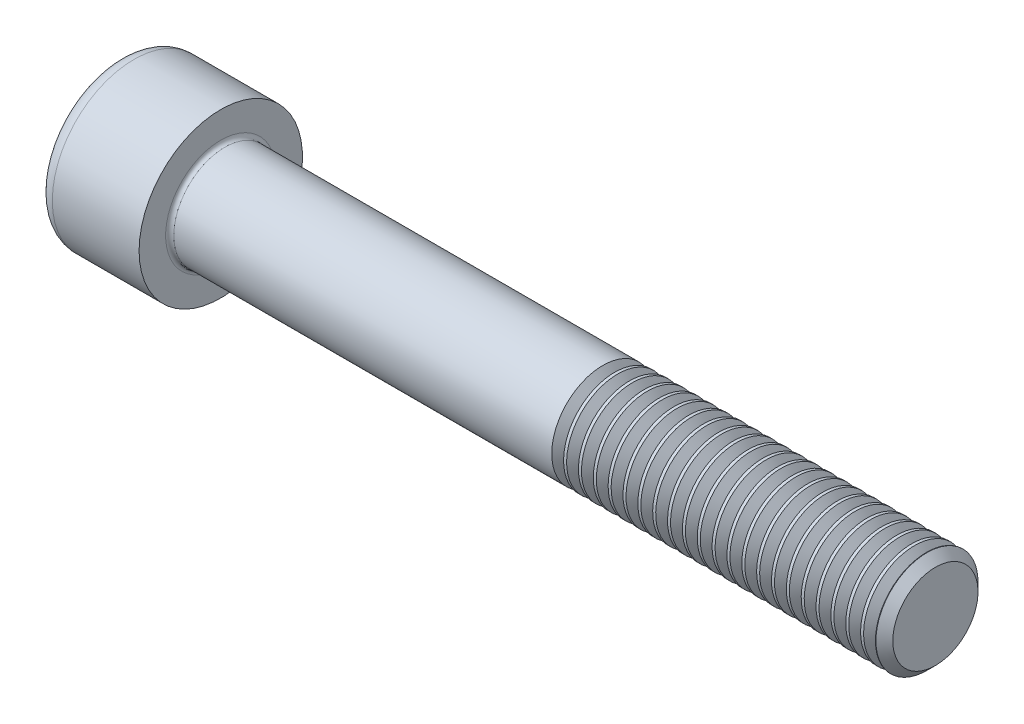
ISO-10303-21;
HEADER;
FILE_DESCRIPTION(('STEP AP214'),'2;1');
FILE_NAME('part.step','',(''),(''),'','','');
FILE_SCHEMA(('AUTOMOTIVE_DESIGN { 1 0 10303 214 1 1 1 1 }'));
ENDSEC;
DATA;
#1=APPLICATION_CONTEXT('core data for automotive mechanical design processes');
#2=APPLICATION_PROTOCOL_DEFINITION('international standard','automotive_design',2000,#1);
#3=PRODUCT_CONTEXT('',#1,'mechanical');
#4=PRODUCT('Part','Part','',(#3));
#5=PRODUCT_RELATED_PRODUCT_CATEGORY('part','',(#4));
#6=PRODUCT_DEFINITION_FORMATION('','',#4);
#7=PRODUCT_DEFINITION_CONTEXT('part definition',#1,'design');
#8=PRODUCT_DEFINITION('design','',#6,#7);
#9=PRODUCT_DEFINITION_SHAPE('','',#8);
#10=(LENGTH_UNIT() NAMED_UNIT(*) SI_UNIT(.MILLI.,.METRE.));
#11=(NAMED_UNIT(*) PLANE_ANGLE_UNIT() SI_UNIT($,.RADIAN.));
#12=(NAMED_UNIT(*) SI_UNIT($,.STERADIAN.) SOLID_ANGLE_UNIT());
#13=UNCERTAINTY_MEASURE_WITH_UNIT(LENGTH_MEASURE(1.E-05),#10,'distance_accuracy_value','');
#14=(GEOMETRIC_REPRESENTATION_CONTEXT(3) GLOBAL_UNCERTAINTY_ASSIGNED_CONTEXT((#13)) GLOBAL_UNIT_ASSIGNED_CONTEXT((#10,
#11,#12)) REPRESENTATION_CONTEXT('',''));
#15=CARTESIAN_POINT('',(0.,0.,0.));
#16=DIRECTION('',(0.,0.,1.));
#17=DIRECTION('',(1.,0.,0.));
#18=AXIS2_PLACEMENT_3D('',#15,#16,#17);
#19=CARTESIAN_POINT('',(0.,0.,0.));
#20=DIRECTION('',(-1.,0.,0.));
#21=DIRECTION('',(0.,0.,1.));
#22=AXIS2_PLACEMENT_3D('',#19,#20,#21);
#23=PLANE('',#22);
#24=DIRECTION('',(0.,-0.499999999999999,0.866025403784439));
#25=VECTOR('',#24,1.);
#26=CARTESIAN_POINT('',(0.,4.68519743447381,0.));
#27=LINE('',#26,#25);
#28=CARTESIAN_POINT('',(0.,4.68519743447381,0.));
#29=VERTEX_POINT('',#28);
#30=CARTESIAN_POINT('',(0.,2.34259871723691,4.05749999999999));
#31=VERTEX_POINT('',#30);
#32=EDGE_CURVE('E110',#29,#31,#27,.T.);
#33=ORIENTED_EDGE('',*,*,#32,.T.);
#34=DIRECTION('',(0.,1.,0.));
#35=VECTOR('',#34,1.);
#36=CARTESIAN_POINT('',(0.,-2.3425987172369,4.0575));
#37=LINE('',#36,#35);
#38=CARTESIAN_POINT('',(0.,-2.3425987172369,4.0575));
#39=VERTEX_POINT('',#38);
#40=EDGE_CURVE('E99',#39,#31,#37,.T.);
#41=ORIENTED_EDGE('',*,*,#40,.F.);
#42=DIRECTION('',(0.,-0.500000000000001,-0.866025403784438));
#43=VECTOR('',#42,1.);
#44=CARTESIAN_POINT('',(0.,-2.3425987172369,4.0575));
#45=LINE('',#44,#43);
#46=CARTESIAN_POINT('',(0.,-4.68519743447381,0.));
#47=VERTEX_POINT('',#46);
#48=EDGE_CURVE('E109',#39,#47,#45,.T.);
#49=ORIENTED_EDGE('',*,*,#48,.T.);
#50=DIRECTION('',(0.,0.499999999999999,-0.866025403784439));
#51=VECTOR('',#50,1.);
#52=CARTESIAN_POINT('',(0.,-4.68519743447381,0.));
#53=LINE('',#52,#51);
#54=CARTESIAN_POINT('',(0.,-2.34259871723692,-4.0575));
#55=VERTEX_POINT('',#54);
#56=EDGE_CURVE('E133',#47,#55,#53,.T.);
#57=ORIENTED_EDGE('',*,*,#56,.T.);
#58=DIRECTION('',(0.,-1.,0.));
#59=VECTOR('',#58,1.);
#60=CARTESIAN_POINT('',(0.,2.3425987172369,-4.0575));
#61=LINE('',#60,#59);
#62=CARTESIAN_POINT('',(0.,2.3425987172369,-4.0575));
#63=VERTEX_POINT('',#62);
#64=EDGE_CURVE('E136',#63,#55,#61,.T.);
#65=ORIENTED_EDGE('',*,*,#64,.F.);
#66=DIRECTION('',(0.,-0.500000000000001,-0.866025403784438));
#67=VECTOR('',#66,1.);
#68=CARTESIAN_POINT('',(0.,4.68519743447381,0.));
#69=LINE('',#68,#67);
#70=EDGE_CURVE('E124',#29,#63,#69,.T.);
#71=ORIENTED_EDGE('',*,*,#70,.F.);
#72=EDGE_LOOP('',(#33,#41,#49,#57,#65,#71));
#73=FACE_BOUND('',#72,.T.);
#74=CARTESIAN_POINT('',(0.,0.,0.));
#75=DIRECTION('',(-1.,0.,0.));
#76=DIRECTION('',(0.,0.,1.));
#77=AXIS2_PLACEMENT_3D('',#74,#75,#76);
#78=CIRCLE('',#77,6.5);
#79=CARTESIAN_POINT('',(0.,0.,6.5));
#80=VERTEX_POINT('',#79);
#81=EDGE_CURVE('E35',#80,#80,#78,.T.);
#82=ORIENTED_EDGE('',*,*,#81,.T.);
#83=EDGE_LOOP('',(#82));
#84=FACE_BOUND('',#83,.T.);
#85=ADVANCED_FACE('F28',(#73,#84),#23,.T.);
#86=CARTESIAN_POINT('',(-31.75,0.,0.));
#87=DIRECTION('',(-1.,0.,0.));
#88=DIRECTION('',(0.,0.,1.));
#89=AXIS2_PLACEMENT_3D('',#86,#87,#88);
#90=CYLINDRICAL_SURFACE('',#89,8.);
#91=CARTESIAN_POINT('',(1.5,0.,0.));
#92=DIRECTION('',(-1.,0.,0.));
#93=DIRECTION('',(0.,0.,1.));
#94=AXIS2_PLACEMENT_3D('',#91,#92,#93);
#95=CIRCLE('',#94,8.);
#96=CARTESIAN_POINT('',(1.5,0.,8.));
#97=VERTEX_POINT('',#96);
#98=EDGE_CURVE('E11',#97,#97,#95,.F.);
#99=ORIENTED_EDGE('',*,*,#98,.T.);
#100=EDGE_LOOP('',(#99));
#101=FACE_BOUND('',#100,.T.);
#102=CARTESIAN_POINT('',(10.,0.,0.));
#103=DIRECTION('',(-1.,0.,0.));
#104=DIRECTION('',(0.,0.,1.));
#105=AXIS2_PLACEMENT_3D('',#102,#103,#104);
#106=CIRCLE('',#105,8.);
#107=CARTESIAN_POINT('',(10.,0.,8.));
#108=VERTEX_POINT('',#107);
#109=EDGE_CURVE('E181',#108,#108,#106,.T.);
#110=ORIENTED_EDGE('',*,*,#109,.T.);
#111=EDGE_LOOP('',(#110));
#112=FACE_BOUND('',#111,.T.);
#113=ADVANCED_FACE('F208',(#101,#112),#90,.T.);
#114=CARTESIAN_POINT('',(10.,8.,0.));
#115=DIRECTION('',(1.,0.,0.));
#116=DIRECTION('',(0.,0.,-1.));
#117=AXIS2_PLACEMENT_3D('',#114,#115,#116);
#118=PLANE('',#117);
#119=CARTESIAN_POINT('',(10.,0.,0.));
#120=DIRECTION('',(1.,0.,0.));
#121=DIRECTION('',(0.,0.,-1.));
#122=AXIS2_PLACEMENT_3D('',#119,#120,#121);
#123=CIRCLE('',#122,5.4);
#124=CARTESIAN_POINT('',(10.,0.,-5.4));
#125=VERTEX_POINT('',#124);
#126=EDGE_CURVE('E184',#125,#125,#123,.F.);
#127=ORIENTED_EDGE('',*,*,#126,.T.);
#128=EDGE_LOOP('',(#127));
#129=FACE_BOUND('',#128,.T.);
#130=ORIENTED_EDGE('',*,*,#109,.F.);
#131=EDGE_LOOP('',(#130));
#132=FACE_BOUND('',#131,.T.);
#133=ADVANCED_FACE('F212',(#129,#132),#118,.T.);
#134=CARTESIAN_POINT('',(-31.75,0.,0.));
#135=DIRECTION('',(-1.,0.,0.));
#136=DIRECTION('',(0.,0.,1.));
#137=AXIS2_PLACEMENT_3D('',#134,#135,#136);
#138=CYLINDRICAL_SURFACE('',#137,5.);
#139=CARTESIAN_POINT('',(47.4202281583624,0.,0.));
#140=DIRECTION('',(-1.,0.,0.));
#141=DIRECTION('',(0.,-1.,0.));
#142=AXIS2_PLACEMENT_3D('',#139,#140,#141);
#143=CIRCLE('',#142,5.00000000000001);
#144=CARTESIAN_POINT('',(47.4202281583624,-5.,0.));
#145=VERTEX_POINT('',#144);
#146=EDGE_CURVE('E128',#145,#145,#143,.T.);
#147=ORIENTED_EDGE('',*,*,#146,.T.);
#148=EDGE_LOOP('',(#147));
#149=FACE_BOUND('',#148,.T.);
#150=CARTESIAN_POINT('',(10.4,0.,0.));
#151=DIRECTION('',(1.,0.,0.));
#152=DIRECTION('',(0.,0.,-1.));
#153=AXIS2_PLACEMENT_3D('',#150,#151,#152);
#154=CIRCLE('',#153,5.);
#155=CARTESIAN_POINT('',(10.4,0.,-5.));
#156=VERTEX_POINT('',#155);
#157=EDGE_CURVE('E187',#156,#156,#154,.T.);
#158=ORIENTED_EDGE('',*,*,#157,.T.);
#159=EDGE_LOOP('',(#158));
#160=FACE_BOUND('',#159,.T.);
#161=ADVANCED_FACE('F202',(#149,#160),#138,.T.);
#162=CARTESIAN_POINT('',(10.4,0.,0.));
#163=DIRECTION('',(1.,0.,0.));
#164=DIRECTION('',(0.,0.,-1.));
#165=AXIS2_PLACEMENT_3D('',#162,#163,#164);
#166=TOROIDAL_SURFACE('',#165,5.4,0.4);
#167=ORIENTED_EDGE('',*,*,#157,.F.);
#168=EDGE_LOOP('',(#167));
#169=FACE_BOUND('',#168,.T.);
#170=ORIENTED_EDGE('',*,*,#126,.F.);
#171=EDGE_LOOP('',(#170));
#172=FACE_BOUND('',#171,.T.);
#173=ADVANCED_FACE('F194',(#169,#172),#166,.F.);
#174=CARTESIAN_POINT('',(1.5,0.,0.));
#175=DIRECTION('',(-1.,0.,0.));
#176=DIRECTION('',(0.,0.,1.));
#177=AXIS2_PLACEMENT_3D('',#174,#175,#176);
#178=TOROIDAL_SURFACE('',#177,6.5,1.5);
#179=ORIENTED_EDGE('',*,*,#98,.F.);
#180=EDGE_LOOP('',(#179));
#181=FACE_BOUND('',#180,.T.);
#182=ORIENTED_EDGE('',*,*,#81,.F.);
#183=EDGE_LOOP('',(#182));
#184=FACE_BOUND('',#183,.T.);
#185=ADVANCED_FACE('F192',(#181,#184),#178,.T.);
#186=CARTESIAN_POINT('',(5.,4.68519743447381,0.));
#187=DIRECTION('',(0.,-0.866025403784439,-0.499999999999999));
#188=DIRECTION('',(0.,0.499999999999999,-0.866025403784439));
#189=AXIS2_PLACEMENT_3D('',#186,#187,#188);
#190=PLANE('',#189);
#191=ORIENTED_EDGE('',*,*,#32,.F.);
#192=DIRECTION('',(-1.,0.,0.));
#193=VECTOR('',#192,1.);
#194=CARTESIAN_POINT('',(5.,4.68519743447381,0.));
#195=LINE('',#194,#193);
#196=CARTESIAN_POINT('',(5.,4.68519743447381,0.));
#197=VERTEX_POINT('',#196);
#198=EDGE_CURVE('E159',#197,#29,#195,.T.);
#199=ORIENTED_EDGE('',*,*,#198,.F.);
#200=DIRECTION('',(0.,-0.499999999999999,0.866025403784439));
#201=VECTOR('',#200,1.);
#202=CARTESIAN_POINT('',(5.,4.68519743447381,0.));
#203=LINE('',#202,#201);
#204=CARTESIAN_POINT('',(5.,3.51389807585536,2.02874999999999));
#205=VERTEX_POINT('',#204);
#206=EDGE_CURVE('E139',#197,#205,#203,.T.);
#207=ORIENTED_EDGE('',*,*,#206,.T.);
#208=CARTESIAN_POINT('',(5.,2.34259871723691,4.05749999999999));
#209=VERTEX_POINT('',#208);
#210=EDGE_CURVE('E118',#205,#209,#203,.T.);
#211=ORIENTED_EDGE('',*,*,#210,.T.);
#212=DIRECTION('',(-1.,0.,0.));
#213=VECTOR('',#212,1.);
#214=CARTESIAN_POINT('',(5.,2.34259871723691,4.05749999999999));
#215=LINE('',#214,#213);
#216=EDGE_CURVE('E103',#209,#31,#215,.T.);
#217=ORIENTED_EDGE('',*,*,#216,.T.);
#218=EDGE_LOOP('',(#191,#199,#207,#211,#217));
#219=FACE_BOUND('',#218,.T.);
#220=ADVANCED_FACE('F114',(#219),#190,.T.);
#221=CARTESIAN_POINT('',(5.,-2.3425987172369,4.0575));
#222=DIRECTION('',(0.,0.,1.));
#223=DIRECTION('',(0.,-1.,0.));
#224=AXIS2_PLACEMENT_3D('',#221,#222,#223);
#225=PLANE('',#224);
#226=ORIENTED_EDGE('',*,*,#40,.T.);
#227=ORIENTED_EDGE('',*,*,#216,.F.);
#228=DIRECTION('',(0.,1.,0.));
#229=VECTOR('',#228,1.);
#230=CARTESIAN_POINT('',(5.,-2.3425987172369,4.0575));
#231=LINE('',#230,#229);
#232=CARTESIAN_POINT('',(5.,0.,4.0575));
#233=VERTEX_POINT('',#232);
#234=EDGE_CURVE('E141',#233,#209,#231,.T.);
#235=ORIENTED_EDGE('',*,*,#234,.F.);
#236=CARTESIAN_POINT('',(5.,-2.3425987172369,4.0575));
#237=VERTEX_POINT('',#236);
#238=EDGE_CURVE('E142',#237,#233,#231,.T.);
#239=ORIENTED_EDGE('',*,*,#238,.F.);
#240=DIRECTION('',(-1.,0.,0.));
#241=VECTOR('',#240,1.);
#242=CARTESIAN_POINT('',(5.,-2.3425987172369,4.0575));
#243=LINE('',#242,#241);
#244=EDGE_CURVE('E105',#237,#39,#243,.T.);
#245=ORIENTED_EDGE('',*,*,#244,.T.);
#246=EDGE_LOOP('',(#226,#227,#235,#239,#245));
#247=FACE_BOUND('',#246,.T.);
#248=ADVANCED_FACE('F101',(#247),#225,.F.);
#249=CARTESIAN_POINT('',(5.,-2.3425987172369,4.0575));
#250=DIRECTION('',(0.,0.866025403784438,-0.500000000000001));
#251=DIRECTION('',(0.,0.500000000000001,0.866025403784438));
#252=AXIS2_PLACEMENT_3D('',#249,#250,#251);
#253=PLANE('',#252);
#254=ORIENTED_EDGE('',*,*,#48,.F.);
#255=ORIENTED_EDGE('',*,*,#244,.F.);
#256=DIRECTION('',(0.,-0.500000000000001,-0.866025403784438));
#257=VECTOR('',#256,1.);
#258=CARTESIAN_POINT('',(5.,-2.3425987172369,4.0575));
#259=LINE('',#258,#257);
#260=CARTESIAN_POINT('',(5.,-3.51389807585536,2.02875));
#261=VERTEX_POINT('',#260);
#262=EDGE_CURVE('E146',#237,#261,#259,.T.);
#263=ORIENTED_EDGE('',*,*,#262,.T.);
#264=CARTESIAN_POINT('',(5.,-4.68519743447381,0.));
#265=VERTEX_POINT('',#264);
#266=EDGE_CURVE('E145',#261,#265,#259,.T.);
#267=ORIENTED_EDGE('',*,*,#266,.T.);
#268=DIRECTION('',(-1.,0.,0.));
#269=VECTOR('',#268,1.);
#270=CARTESIAN_POINT('',(5.,-4.68519743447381,0.));
#271=LINE('',#270,#269);
#272=EDGE_CURVE('E167',#265,#47,#271,.T.);
#273=ORIENTED_EDGE('',*,*,#272,.T.);
#274=EDGE_LOOP('',(#254,#255,#263,#267,#273));
#275=FACE_BOUND('',#274,.T.);
#276=ADVANCED_FACE('F456',(#275),#253,.T.);
#277=CARTESIAN_POINT('',(5.,-4.68519743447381,0.));
#278=DIRECTION('',(0.,0.866025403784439,0.499999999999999));
#279=DIRECTION('',(0.,-0.499999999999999,0.866025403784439));
#280=AXIS2_PLACEMENT_3D('',#277,#278,#279);
#281=PLANE('',#280);
#282=ORIENTED_EDGE('',*,*,#56,.F.);
#283=ORIENTED_EDGE('',*,*,#272,.F.);
#284=DIRECTION('',(0.,0.499999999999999,-0.866025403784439));
#285=VECTOR('',#284,1.);
#286=CARTESIAN_POINT('',(5.,-4.68519743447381,0.));
#287=LINE('',#286,#285);
#288=CARTESIAN_POINT('',(5.,-3.51389807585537,-2.02875));
#289=VERTEX_POINT('',#288);
#290=EDGE_CURVE('E150',#265,#289,#287,.T.);
#291=ORIENTED_EDGE('',*,*,#290,.T.);
#292=CARTESIAN_POINT('',(5.,-2.34259871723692,-4.0575));
#293=VERTEX_POINT('',#292);
#294=EDGE_CURVE('E149',#289,#293,#287,.T.);
#295=ORIENTED_EDGE('',*,*,#294,.T.);
#296=DIRECTION('',(-1.,0.,0.));
#297=VECTOR('',#296,1.);
#298=CARTESIAN_POINT('',(5.,-2.34259871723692,-4.0575));
#299=LINE('',#298,#297);
#300=EDGE_CURVE('E164',#293,#55,#299,.T.);
#301=ORIENTED_EDGE('',*,*,#300,.T.);
#302=EDGE_LOOP('',(#282,#283,#291,#295,#301));
#303=FACE_BOUND('',#302,.T.);
#304=ADVANCED_FACE('F452',(#303),#281,.T.);
#305=CARTESIAN_POINT('',(5.,2.3425987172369,-4.0575));
#306=DIRECTION('',(0.,0.,-1.));
#307=DIRECTION('',(0.,1.,0.));
#308=AXIS2_PLACEMENT_3D('',#305,#306,#307);
#309=PLANE('',#308);
#310=ORIENTED_EDGE('',*,*,#64,.T.);
#311=ORIENTED_EDGE('',*,*,#300,.F.);
#312=DIRECTION('',(0.,-1.,0.));
#313=VECTOR('',#312,1.);
#314=CARTESIAN_POINT('',(5.,2.3425987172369,-4.0575));
#315=LINE('',#314,#313);
#316=CARTESIAN_POINT('',(5.,0.,-4.0575));
#317=VERTEX_POINT('',#316);
#318=EDGE_CURVE('E153',#317,#293,#315,.T.);
#319=ORIENTED_EDGE('',*,*,#318,.F.);
#320=CARTESIAN_POINT('',(5.,2.3425987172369,-4.0575));
#321=VERTEX_POINT('',#320);
#322=EDGE_CURVE('E42',#321,#317,#315,.T.);
#323=ORIENTED_EDGE('',*,*,#322,.F.);
#324=DIRECTION('',(-1.,0.,0.));
#325=VECTOR('',#324,1.);
#326=CARTESIAN_POINT('',(5.,2.3425987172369,-4.0575));
#327=LINE('',#326,#325);
#328=EDGE_CURVE('E161',#321,#63,#327,.T.);
#329=ORIENTED_EDGE('',*,*,#328,.T.);
#330=EDGE_LOOP('',(#310,#311,#319,#323,#329));
#331=FACE_BOUND('',#330,.T.);
#332=ADVANCED_FACE('F448',(#331),#309,.F.);
#333=CARTESIAN_POINT('',(5.,4.68519743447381,0.));
#334=DIRECTION('',(0.,0.866025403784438,-0.500000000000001));
#335=DIRECTION('',(0.,0.500000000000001,0.866025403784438));
#336=AXIS2_PLACEMENT_3D('',#333,#334,#335);
#337=PLANE('',#336);
#338=ORIENTED_EDGE('',*,*,#70,.T.);
#339=ORIENTED_EDGE('',*,*,#328,.F.);
#340=DIRECTION('',(0.,-0.500000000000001,-0.866025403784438));
#341=VECTOR('',#340,1.);
#342=CARTESIAN_POINT('',(5.,4.68519743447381,0.));
#343=LINE('',#342,#341);
#344=CARTESIAN_POINT('',(5.,3.51389807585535,-2.02875));
#345=VERTEX_POINT('',#344);
#346=EDGE_CURVE('E155',#345,#321,#343,.T.);
#347=ORIENTED_EDGE('',*,*,#346,.F.);
#348=EDGE_CURVE('E156',#197,#345,#343,.T.);
#349=ORIENTED_EDGE('',*,*,#348,.F.);
#350=ORIENTED_EDGE('',*,*,#198,.T.);
#351=EDGE_LOOP('',(#338,#339,#347,#349,#350));
#352=FACE_BOUND('',#351,.T.);
#353=ADVANCED_FACE('F443',(#352),#337,.F.);
#354=CARTESIAN_POINT('',(5.,7.02779615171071,-4.05750000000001));
#355=DIRECTION('',(1.,0.,0.));
#356=DIRECTION('',(0.,0.,-1.));
#357=AXIS2_PLACEMENT_3D('',#354,#355,#356);
#358=PLANE('',#357);
#359=ORIENTED_EDGE('',*,*,#318,.T.);
#360=ORIENTED_EDGE('',*,*,#294,.F.);
#361=CARTESIAN_POINT('',(5.,0.,0.));
#362=DIRECTION('',(-1.,0.,0.));
#363=DIRECTION('',(0.,0.,1.));
#364=AXIS2_PLACEMENT_3D('',#361,#362,#363);
#365=CIRCLE('',#364,4.0575);
#366=EDGE_CURVE('E482',#317,#289,#365,.T.);
#367=ORIENTED_EDGE('',*,*,#366,.F.);
#368=EDGE_LOOP('',(#359,#360,#367));
#369=FACE_BOUND('',#368,.T.);
#370=ADVANCED_FACE('F439',(#369),#358,.F.);
#371=ORIENTED_EDGE('',*,*,#290,.F.);
#372=ORIENTED_EDGE('',*,*,#266,.F.);
#373=EDGE_CURVE('E480',#289,#261,#365,.T.);
#374=ORIENTED_EDGE('',*,*,#373,.F.);
#375=EDGE_LOOP('',(#371,#372,#374));
#376=FACE_BOUND('',#375,.T.);
#377=ADVANCED_FACE('F442',(#376),#358,.F.);
#378=ORIENTED_EDGE('',*,*,#262,.F.);
#379=ORIENTED_EDGE('',*,*,#238,.T.);
#380=EDGE_CURVE('E119',#261,#233,#365,.T.);
#381=ORIENTED_EDGE('',*,*,#380,.F.);
#382=EDGE_LOOP('',(#378,#379,#381));
#383=FACE_BOUND('',#382,.T.);
#384=ADVANCED_FACE('F476',(#383),#358,.F.);
#385=ORIENTED_EDGE('',*,*,#234,.T.);
#386=ORIENTED_EDGE('',*,*,#210,.F.);
#387=EDGE_CURVE('E171',#233,#205,#365,.T.);
#388=ORIENTED_EDGE('',*,*,#387,.F.);
#389=EDGE_LOOP('',(#385,#386,#388));
#390=FACE_BOUND('',#389,.T.);
#391=ADVANCED_FACE('F473',(#390),#358,.F.);
#392=ORIENTED_EDGE('',*,*,#206,.F.);
#393=ORIENTED_EDGE('',*,*,#348,.T.);
#394=EDGE_CURVE('E175',#205,#345,#365,.T.);
#395=ORIENTED_EDGE('',*,*,#394,.F.);
#396=EDGE_LOOP('',(#392,#393,#395));
#397=FACE_BOUND('',#396,.T.);
#398=ADVANCED_FACE('F466',(#397),#358,.F.);
#399=ORIENTED_EDGE('',*,*,#346,.T.);
#400=ORIENTED_EDGE('',*,*,#322,.T.);
#401=EDGE_CURVE('E486',#345,#317,#365,.T.);
#402=ORIENTED_EDGE('',*,*,#401,.F.);
#403=EDGE_LOOP('',(#399,#400,#402));
#404=FACE_BOUND('',#403,.T.);
#405=ADVANCED_FACE('F445',(#404),#358,.F.);
#406=CARTESIAN_POINT('',(5.,0.,0.));
#407=DIRECTION('',(-1.,0.,0.));
#408=DIRECTION('',(0.,0.,1.));
#409=AXIS2_PLACEMENT_3D('',#406,#407,#408);
#410=CONICAL_SURFACE('',#409,4.0575,1.04719755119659);
#411=CARTESIAN_POINT('',(7.34259871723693,0.,0.));
#412=VERTEX_POINT('',#411);
#413=VERTEX_LOOP('',#412);
#414=FACE_BOUND('',#413,.T.);
#415=ORIENTED_EDGE('',*,*,#387,.T.);
#416=ORIENTED_EDGE('',*,*,#394,.T.);
#417=ORIENTED_EDGE('',*,*,#401,.T.);
#418=ORIENTED_EDGE('',*,*,#366,.T.);
#419=ORIENTED_EDGE('',*,*,#373,.T.);
#420=ORIENTED_EDGE('',*,*,#380,.T.);
#421=EDGE_LOOP('',(#415,#416,#417,#418,#419,#420));
#422=FACE_BOUND('',#421,.T.);
#423=ADVANCED_FACE('F437',(#414,#422),#410,.F.);
#424=CARTESIAN_POINT('',(48.5797718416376,0.,0.));
#425=DIRECTION('',(1.,0.,0.));
#426=DIRECTION('',(0.,1.,0.));
#427=AXIS2_PLACEMENT_3D('',#424,#425,#426);
#428=CONICAL_SURFACE('',#427,5.00000000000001,0.959931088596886);
#429=CARTESIAN_POINT('',(48.,0.,0.));
#430=DIRECTION('',(-1.,0.,0.));
#431=DIRECTION('',(0.,-1.,0.));
#432=AXIS2_PLACEMENT_3D('',#429,#430,#431);
#433=CIRCLE('',#432,4.17200000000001);
#434=CARTESIAN_POINT('',(48.,-4.172,0.));
#435=VERTEX_POINT('',#434);
#436=EDGE_CURVE('E1245',#435,#435,#433,.T.);
#437=ORIENTED_EDGE('',*,*,#436,.F.);
#438=EDGE_LOOP('',(#437));
#439=FACE_BOUND('',#438,.T.);
#440=CARTESIAN_POINT('',(48.5797718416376,0.,0.));
#441=DIRECTION('',(-1.,0.,0.));
#442=DIRECTION('',(0.,-1.,0.));
#443=AXIS2_PLACEMENT_3D('',#440,#441,#442);
#444=CIRCLE('',#443,5.00000000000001);
#445=CARTESIAN_POINT('',(48.5797718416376,-5.,0.));
#446=VERTEX_POINT('',#445);
#447=EDGE_CURVE('E125',#446,#446,#444,.T.);
#448=ORIENTED_EDGE('',*,*,#447,.T.);
#449=EDGE_LOOP('',(#448));
#450=FACE_BOUND('',#449,.T.);
#451=ADVANCED_FACE('F433',(#439,#450),#428,.T.);
#452=CARTESIAN_POINT('',(48.,0.,0.));
#453=DIRECTION('',(-1.,0.,0.));
#454=DIRECTION('',(0.,-1.,0.));
#455=AXIS2_PLACEMENT_3D('',#452,#453,#454);
#456=CONICAL_SURFACE('',#455,4.17200000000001,0.95993108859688);
#457=ORIENTED_EDGE('',*,*,#146,.F.);
#458=EDGE_LOOP('',(#457));
#459=FACE_BOUND('',#458,.T.);
#460=ORIENTED_EDGE('',*,*,#436,.T.);
#461=EDGE_LOOP('',(#460));
#462=FACE_BOUND('',#461,.T.);
#463=ADVANCED_FACE('F430',(#459,#462),#456,.T.);
#464=CARTESIAN_POINT('',(48.8747736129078,0.,0.));
#465=DIRECTION('',(-1.,0.,0.));
#466=DIRECTION('',(0.,-1.,0.));
#467=AXIS2_PLACEMENT_3D('',#464,#465,#466);
#468=CIRCLE('',#467,5.00000000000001);
#469=CARTESIAN_POINT('',(48.8747736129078,-5.,0.));
#470=VERTEX_POINT('',#469);
#471=EDGE_CURVE('E1239',#470,#470,#468,.T.);
#472=ORIENTED_EDGE('',*,*,#471,.T.);
#473=EDGE_LOOP('',(#472));
#474=FACE_BOUND('',#473,.T.);
#475=ORIENTED_EDGE('',*,*,#447,.F.);
#476=EDGE_LOOP('',(#475));
#477=FACE_BOUND('',#476,.T.);
#478=ADVANCED_FACE('F225',(#474,#477),#138,.T.);
#479=CARTESIAN_POINT('',(50.0343172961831,0.,0.));
#480=DIRECTION('',(1.,0.,0.));
#481=DIRECTION('',(0.,1.,0.));
#482=AXIS2_PLACEMENT_3D('',#479,#480,#481);
#483=CONICAL_SURFACE('',#482,5.00000000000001,0.959931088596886);
#484=CARTESIAN_POINT('',(49.4545454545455,0.,0.));
#485=DIRECTION('',(-1.,0.,0.));
#486=DIRECTION('',(0.,-1.,0.));
#487=AXIS2_PLACEMENT_3D('',#484,#485,#486);
#488=CIRCLE('',#487,4.17200000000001);
#489=CARTESIAN_POINT('',(49.4545454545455,-4.172,0.));
#490=VERTEX_POINT('',#489);
#491=EDGE_CURVE('E1236',#490,#490,#488,.T.);
#492=ORIENTED_EDGE('',*,*,#491,.F.);
#493=EDGE_LOOP('',(#492));
#494=FACE_BOUND('',#493,.T.);
#495=CARTESIAN_POINT('',(50.0343172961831,0.,0.));
#496=DIRECTION('',(-1.,0.,0.));
#497=DIRECTION('',(0.,-1.,0.));
#498=AXIS2_PLACEMENT_3D('',#495,#496,#497);
#499=CIRCLE('',#498,5.00000000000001);
#500=CARTESIAN_POINT('',(50.0343172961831,-5.,0.));
#501=VERTEX_POINT('',#500);
#502=EDGE_CURVE('E1242',#501,#501,#499,.T.);
#503=ORIENTED_EDGE('',*,*,#502,.T.);
#504=EDGE_LOOP('',(#503));
#505=FACE_BOUND('',#504,.T.);
#506=ADVANCED_FACE('F425',(#494,#505),#483,.T.);
#507=CARTESIAN_POINT('',(49.4545454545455,0.,0.));
#508=DIRECTION('',(-1.,0.,0.));
#509=DIRECTION('',(0.,-1.,0.));
#510=AXIS2_PLACEMENT_3D('',#507,#508,#509);
#511=CONICAL_SURFACE('',#510,4.17200000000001,0.95993108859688);
#512=ORIENTED_EDGE('',*,*,#471,.F.);
#513=EDGE_LOOP('',(#512));
#514=FACE_BOUND('',#513,.T.);
#515=ORIENTED_EDGE('',*,*,#491,.T.);
#516=EDGE_LOOP('',(#515));
#517=FACE_BOUND('',#516,.T.);
#518=ADVANCED_FACE('F422',(#514,#517),#511,.T.);
#519=CARTESIAN_POINT('',(50.3293190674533,0.,0.));
#520=DIRECTION('',(-1.,0.,0.));
#521=DIRECTION('',(0.,-1.,0.));
#522=AXIS2_PLACEMENT_3D('',#519,#520,#521);
#523=CIRCLE('',#522,5.00000000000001);
#524=CARTESIAN_POINT('',(50.3293190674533,-5.,0.));
#525=VERTEX_POINT('',#524);
#526=EDGE_CURVE('E1230',#525,#525,#523,.T.);
#527=ORIENTED_EDGE('',*,*,#526,.T.);
#528=EDGE_LOOP('',(#527));
#529=FACE_BOUND('',#528,.T.);
#530=ORIENTED_EDGE('',*,*,#502,.F.);
#531=EDGE_LOOP('',(#530));
#532=FACE_BOUND('',#531,.T.);
#533=ADVANCED_FACE('F420',(#529,#532),#138,.T.);
#534=CARTESIAN_POINT('',(51.4888627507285,0.,0.));
#535=DIRECTION('',(1.,0.,0.));
#536=DIRECTION('',(0.,1.,0.));
#537=AXIS2_PLACEMENT_3D('',#534,#535,#536);
#538=CONICAL_SURFACE('',#537,5.00000000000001,0.959931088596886);
#539=CARTESIAN_POINT('',(50.9090909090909,0.,0.));
#540=DIRECTION('',(-1.,0.,0.));
#541=DIRECTION('',(0.,-1.,0.));
#542=AXIS2_PLACEMENT_3D('',#539,#540,#541);
#543=CIRCLE('',#542,4.17200000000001);
#544=CARTESIAN_POINT('',(50.9090909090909,-4.172,0.));
#545=VERTEX_POINT('',#544);
#546=EDGE_CURVE('E1227',#545,#545,#543,.T.);
#547=ORIENTED_EDGE('',*,*,#546,.F.);
#548=EDGE_LOOP('',(#547));
#549=FACE_BOUND('',#548,.T.);
#550=CARTESIAN_POINT('',(51.4888627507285,0.,0.));
#551=DIRECTION('',(-1.,0.,0.));
#552=DIRECTION('',(0.,-1.,0.));
#553=AXIS2_PLACEMENT_3D('',#550,#551,#552);
#554=CIRCLE('',#553,5.00000000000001);
#555=CARTESIAN_POINT('',(51.4888627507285,-5.,0.));
#556=VERTEX_POINT('',#555);
#557=EDGE_CURVE('E1233',#556,#556,#554,.T.);
#558=ORIENTED_EDGE('',*,*,#557,.T.);
#559=EDGE_LOOP('',(#558));
#560=FACE_BOUND('',#559,.T.);
#561=ADVANCED_FACE('F416',(#549,#560),#538,.T.);
#562=CARTESIAN_POINT('',(50.9090909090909,0.,0.));
#563=DIRECTION('',(-1.,0.,0.));
#564=DIRECTION('',(0.,-1.,0.));
#565=AXIS2_PLACEMENT_3D('',#562,#563,#564);
#566=CONICAL_SURFACE('',#565,4.17200000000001,0.95993108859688);
#567=ORIENTED_EDGE('',*,*,#526,.F.);
#568=EDGE_LOOP('',(#567));
#569=FACE_BOUND('',#568,.T.);
#570=ORIENTED_EDGE('',*,*,#546,.T.);
#571=EDGE_LOOP('',(#570));
#572=FACE_BOUND('',#571,.T.);
#573=ADVANCED_FACE('F413',(#569,#572),#566,.T.);
#574=CARTESIAN_POINT('',(51.7838645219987,0.,0.));
#575=DIRECTION('',(-1.,0.,0.));
#576=DIRECTION('',(0.,-1.,0.));
#577=AXIS2_PLACEMENT_3D('',#574,#575,#576);
#578=CIRCLE('',#577,5.00000000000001);
#579=CARTESIAN_POINT('',(51.7838645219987,-5.,0.));
#580=VERTEX_POINT('',#579);
#581=EDGE_CURVE('E1221',#580,#580,#578,.T.);
#582=ORIENTED_EDGE('',*,*,#581,.T.);
#583=EDGE_LOOP('',(#582));
#584=FACE_BOUND('',#583,.T.);
#585=ORIENTED_EDGE('',*,*,#557,.F.);
#586=EDGE_LOOP('',(#585));
#587=FACE_BOUND('',#586,.T.);
#588=ADVANCED_FACE('F411',(#584,#587),#138,.T.);
#589=CARTESIAN_POINT('',(52.943408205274,0.,0.));
#590=DIRECTION('',(1.,0.,0.));
#591=DIRECTION('',(0.,1.,0.));
#592=AXIS2_PLACEMENT_3D('',#589,#590,#591);
#593=CONICAL_SURFACE('',#592,5.00000000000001,0.959931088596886);
#594=CARTESIAN_POINT('',(52.3636363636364,0.,0.));
#595=DIRECTION('',(-1.,0.,0.));
#596=DIRECTION('',(0.,-1.,0.));
#597=AXIS2_PLACEMENT_3D('',#594,#595,#596);
#598=CIRCLE('',#597,4.17200000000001);
#599=CARTESIAN_POINT('',(52.3636363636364,-4.172,0.));
#600=VERTEX_POINT('',#599);
#601=EDGE_CURVE('E1218',#600,#600,#598,.T.);
#602=ORIENTED_EDGE('',*,*,#601,.F.);
#603=EDGE_LOOP('',(#602));
#604=FACE_BOUND('',#603,.T.);
#605=CARTESIAN_POINT('',(52.943408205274,0.,0.));
#606=DIRECTION('',(-1.,0.,0.));
#607=DIRECTION('',(0.,-1.,0.));
#608=AXIS2_PLACEMENT_3D('',#605,#606,#607);
#609=CIRCLE('',#608,5.00000000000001);
#610=CARTESIAN_POINT('',(52.943408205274,-5.,0.));
#611=VERTEX_POINT('',#610);
#612=EDGE_CURVE('E1224',#611,#611,#609,.T.);
#613=ORIENTED_EDGE('',*,*,#612,.T.);
#614=EDGE_LOOP('',(#613));
#615=FACE_BOUND('',#614,.T.);
#616=ADVANCED_FACE('F407',(#604,#615),#593,.T.);
#617=CARTESIAN_POINT('',(52.3636363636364,0.,0.));
#618=DIRECTION('',(-1.,0.,0.));
#619=DIRECTION('',(0.,-1.,0.));
#620=AXIS2_PLACEMENT_3D('',#617,#618,#619);
#621=CONICAL_SURFACE('',#620,4.17200000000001,0.95993108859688);
#622=ORIENTED_EDGE('',*,*,#581,.F.);
#623=EDGE_LOOP('',(#622));
#624=FACE_BOUND('',#623,.T.);
#625=ORIENTED_EDGE('',*,*,#601,.T.);
#626=EDGE_LOOP('',(#625));
#627=FACE_BOUND('',#626,.T.);
#628=ADVANCED_FACE('F404',(#624,#627),#621,.T.);
#629=CARTESIAN_POINT('',(53.2384099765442,0.,0.));
#630=DIRECTION('',(-1.,0.,0.));
#631=DIRECTION('',(0.,-1.,0.));
#632=AXIS2_PLACEMENT_3D('',#629,#630,#631);
#633=CIRCLE('',#632,5.00000000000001);
#634=CARTESIAN_POINT('',(53.2384099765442,-5.,0.));
#635=VERTEX_POINT('',#634);
#636=EDGE_CURVE('E1212',#635,#635,#633,.T.);
#637=ORIENTED_EDGE('',*,*,#636,.T.);
#638=EDGE_LOOP('',(#637));
#639=FACE_BOUND('',#638,.T.);
#640=ORIENTED_EDGE('',*,*,#612,.F.);
#641=EDGE_LOOP('',(#640));
#642=FACE_BOUND('',#641,.T.);
#643=ADVANCED_FACE('F402',(#639,#642),#138,.T.);
#644=CARTESIAN_POINT('',(54.3979536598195,0.,0.));
#645=DIRECTION('',(1.,0.,0.));
#646=DIRECTION('',(0.,1.,0.));
#647=AXIS2_PLACEMENT_3D('',#644,#645,#646);
#648=CONICAL_SURFACE('',#647,5.00000000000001,0.959931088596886);
#649=CARTESIAN_POINT('',(53.8181818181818,0.,0.));
#650=DIRECTION('',(-1.,0.,0.));
#651=DIRECTION('',(0.,-1.,0.));
#652=AXIS2_PLACEMENT_3D('',#649,#650,#651);
#653=CIRCLE('',#652,4.17200000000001);
#654=CARTESIAN_POINT('',(53.8181818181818,-4.172,0.));
#655=VERTEX_POINT('',#654);
#656=EDGE_CURVE('E1209',#655,#655,#653,.T.);
#657=ORIENTED_EDGE('',*,*,#656,.F.);
#658=EDGE_LOOP('',(#657));
#659=FACE_BOUND('',#658,.T.);
#660=CARTESIAN_POINT('',(54.3979536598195,0.,0.));
#661=DIRECTION('',(-1.,0.,0.));
#662=DIRECTION('',(0.,-1.,0.));
#663=AXIS2_PLACEMENT_3D('',#660,#661,#662);
#664=CIRCLE('',#663,5.00000000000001);
#665=CARTESIAN_POINT('',(54.3979536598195,-5.,0.));
#666=VERTEX_POINT('',#665);
#667=EDGE_CURVE('E1215',#666,#666,#664,.T.);
#668=ORIENTED_EDGE('',*,*,#667,.T.);
#669=EDGE_LOOP('',(#668));
#670=FACE_BOUND('',#669,.T.);
#671=ADVANCED_FACE('F398',(#659,#670),#648,.T.);
#672=CARTESIAN_POINT('',(53.8181818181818,0.,0.));
#673=DIRECTION('',(-1.,0.,0.));
#674=DIRECTION('',(0.,-1.,0.));
#675=AXIS2_PLACEMENT_3D('',#672,#673,#674);
#676=CONICAL_SURFACE('',#675,4.17200000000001,0.95993108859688);
#677=ORIENTED_EDGE('',*,*,#636,.F.);
#678=EDGE_LOOP('',(#677));
#679=FACE_BOUND('',#678,.T.);
#680=ORIENTED_EDGE('',*,*,#656,.T.);
#681=EDGE_LOOP('',(#680));
#682=FACE_BOUND('',#681,.T.);
#683=ADVANCED_FACE('F395',(#679,#682),#676,.T.);
#684=CARTESIAN_POINT('',(54.6929554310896,0.,0.));
#685=DIRECTION('',(-1.,0.,0.));
#686=DIRECTION('',(0.,-1.,0.));
#687=AXIS2_PLACEMENT_3D('',#684,#685,#686);
#688=CIRCLE('',#687,5.00000000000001);
#689=CARTESIAN_POINT('',(54.6929554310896,-5.,0.));
#690=VERTEX_POINT('',#689);
#691=EDGE_CURVE('E1203',#690,#690,#688,.T.);
#692=ORIENTED_EDGE('',*,*,#691,.T.);
#693=EDGE_LOOP('',(#692));
#694=FACE_BOUND('',#693,.T.);
#695=ORIENTED_EDGE('',*,*,#667,.F.);
#696=EDGE_LOOP('',(#695));
#697=FACE_BOUND('',#696,.T.);
#698=ADVANCED_FACE('F393',(#694,#697),#138,.T.);
#699=CARTESIAN_POINT('',(55.8524991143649,0.,0.));
#700=DIRECTION('',(1.,0.,0.));
#701=DIRECTION('',(0.,1.,0.));
#702=AXIS2_PLACEMENT_3D('',#699,#700,#701);
#703=CONICAL_SURFACE('',#702,5.00000000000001,0.959931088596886);
#704=CARTESIAN_POINT('',(55.2727272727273,0.,0.));
#705=DIRECTION('',(-1.,0.,0.));
#706=DIRECTION('',(0.,-1.,0.));
#707=AXIS2_PLACEMENT_3D('',#704,#705,#706);
#708=CIRCLE('',#707,4.17200000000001);
#709=CARTESIAN_POINT('',(55.2727272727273,-4.172,0.));
#710=VERTEX_POINT('',#709);
#711=EDGE_CURVE('E1200',#710,#710,#708,.T.);
#712=ORIENTED_EDGE('',*,*,#711,.F.);
#713=EDGE_LOOP('',(#712));
#714=FACE_BOUND('',#713,.T.);
#715=CARTESIAN_POINT('',(55.8524991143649,0.,0.));
#716=DIRECTION('',(-1.,0.,0.));
#717=DIRECTION('',(0.,-1.,0.));
#718=AXIS2_PLACEMENT_3D('',#715,#716,#717);
#719=CIRCLE('',#718,5.00000000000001);
#720=CARTESIAN_POINT('',(55.8524991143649,-5.,0.));
#721=VERTEX_POINT('',#720);
#722=EDGE_CURVE('E1206',#721,#721,#719,.T.);
#723=ORIENTED_EDGE('',*,*,#722,.T.);
#724=EDGE_LOOP('',(#723));
#725=FACE_BOUND('',#724,.T.);
#726=ADVANCED_FACE('F389',(#714,#725),#703,.T.);
#727=CARTESIAN_POINT('',(55.2727272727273,0.,0.));
#728=DIRECTION('',(-1.,0.,0.));
#729=DIRECTION('',(0.,-1.,0.));
#730=AXIS2_PLACEMENT_3D('',#727,#728,#729);
#731=CONICAL_SURFACE('',#730,4.17200000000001,0.95993108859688);
#732=ORIENTED_EDGE('',*,*,#691,.F.);
#733=EDGE_LOOP('',(#732));
#734=FACE_BOUND('',#733,.T.);
#735=ORIENTED_EDGE('',*,*,#711,.T.);
#736=EDGE_LOOP('',(#735));
#737=FACE_BOUND('',#736,.T.);
#738=ADVANCED_FACE('F386',(#734,#737),#731,.T.);
#739=CARTESIAN_POINT('',(56.1475008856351,0.,0.));
#740=DIRECTION('',(-1.,0.,0.));
#741=DIRECTION('',(0.,-1.,0.));
#742=AXIS2_PLACEMENT_3D('',#739,#740,#741);
#743=CIRCLE('',#742,5.00000000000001);
#744=CARTESIAN_POINT('',(56.1475008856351,-5.,0.));
#745=VERTEX_POINT('',#744);
#746=EDGE_CURVE('E1194',#745,#745,#743,.T.);
#747=ORIENTED_EDGE('',*,*,#746,.T.);
#748=EDGE_LOOP('',(#747));
#749=FACE_BOUND('',#748,.T.);
#750=ORIENTED_EDGE('',*,*,#722,.F.);
#751=EDGE_LOOP('',(#750));
#752=FACE_BOUND('',#751,.T.);
#753=ADVANCED_FACE('F384',(#749,#752),#138,.T.);
#754=CARTESIAN_POINT('',(57.3070445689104,0.,0.));
#755=DIRECTION('',(1.,0.,0.));
#756=DIRECTION('',(0.,1.,0.));
#757=AXIS2_PLACEMENT_3D('',#754,#755,#756);
#758=CONICAL_SURFACE('',#757,5.00000000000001,0.959931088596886);
#759=CARTESIAN_POINT('',(56.7272727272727,0.,0.));
#760=DIRECTION('',(-1.,0.,0.));
#761=DIRECTION('',(0.,-1.,0.));
#762=AXIS2_PLACEMENT_3D('',#759,#760,#761);
#763=CIRCLE('',#762,4.17200000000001);
#764=CARTESIAN_POINT('',(56.7272727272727,-4.172,0.));
#765=VERTEX_POINT('',#764);
#766=EDGE_CURVE('E1191',#765,#765,#763,.T.);
#767=ORIENTED_EDGE('',*,*,#766,.F.);
#768=EDGE_LOOP('',(#767));
#769=FACE_BOUND('',#768,.T.);
#770=CARTESIAN_POINT('',(57.3070445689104,0.,0.));
#771=DIRECTION('',(-1.,0.,0.));
#772=DIRECTION('',(0.,-1.,0.));
#773=AXIS2_PLACEMENT_3D('',#770,#771,#772);
#774=CIRCLE('',#773,5.00000000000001);
#775=CARTESIAN_POINT('',(57.3070445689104,-5.,0.));
#776=VERTEX_POINT('',#775);
#777=EDGE_CURVE('E1197',#776,#776,#774,.T.);
#778=ORIENTED_EDGE('',*,*,#777,.T.);
#779=EDGE_LOOP('',(#778));
#780=FACE_BOUND('',#779,.T.);
#781=ADVANCED_FACE('F380',(#769,#780),#758,.T.);
#782=CARTESIAN_POINT('',(56.7272727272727,0.,0.));
#783=DIRECTION('',(-1.,0.,0.));
#784=DIRECTION('',(0.,-1.,0.));
#785=AXIS2_PLACEMENT_3D('',#782,#783,#784);
#786=CONICAL_SURFACE('',#785,4.17200000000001,0.95993108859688);
#787=ORIENTED_EDGE('',*,*,#746,.F.);
#788=EDGE_LOOP('',(#787));
#789=FACE_BOUND('',#788,.T.);
#790=ORIENTED_EDGE('',*,*,#766,.T.);
#791=EDGE_LOOP('',(#790));
#792=FACE_BOUND('',#791,.T.);
#793=ADVANCED_FACE('F377',(#789,#792),#786,.T.);
#794=CARTESIAN_POINT('',(57.6020463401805,0.,0.));
#795=DIRECTION('',(-1.,0.,0.));
#796=DIRECTION('',(0.,-1.,0.));
#797=AXIS2_PLACEMENT_3D('',#794,#795,#796);
#798=CIRCLE('',#797,5.00000000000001);
#799=CARTESIAN_POINT('',(57.6020463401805,-5.,0.));
#800=VERTEX_POINT('',#799);
#801=EDGE_CURVE('E1185',#800,#800,#798,.T.);
#802=ORIENTED_EDGE('',*,*,#801,.T.);
#803=EDGE_LOOP('',(#802));
#804=FACE_BOUND('',#803,.T.);
#805=ORIENTED_EDGE('',*,*,#777,.F.);
#806=EDGE_LOOP('',(#805));
#807=FACE_BOUND('',#806,.T.);
#808=ADVANCED_FACE('F375',(#804,#807),#138,.T.);
#809=CARTESIAN_POINT('',(58.7615900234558,0.,0.));
#810=DIRECTION('',(1.,0.,0.));
#811=DIRECTION('',(0.,1.,0.));
#812=AXIS2_PLACEMENT_3D('',#809,#810,#811);
#813=CONICAL_SURFACE('',#812,5.00000000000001,0.959931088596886);
#814=CARTESIAN_POINT('',(58.1818181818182,0.,0.));
#815=DIRECTION('',(-1.,0.,0.));
#816=DIRECTION('',(0.,-1.,0.));
#817=AXIS2_PLACEMENT_3D('',#814,#815,#816);
#818=CIRCLE('',#817,4.17200000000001);
#819=CARTESIAN_POINT('',(58.1818181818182,-4.172,0.));
#820=VERTEX_POINT('',#819);
#821=EDGE_CURVE('E1182',#820,#820,#818,.T.);
#822=ORIENTED_EDGE('',*,*,#821,.F.);
#823=EDGE_LOOP('',(#822));
#824=FACE_BOUND('',#823,.T.);
#825=CARTESIAN_POINT('',(58.7615900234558,0.,0.));
#826=DIRECTION('',(-1.,0.,0.));
#827=DIRECTION('',(0.,-1.,0.));
#828=AXIS2_PLACEMENT_3D('',#825,#826,#827);
#829=CIRCLE('',#828,5.00000000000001);
#830=CARTESIAN_POINT('',(58.7615900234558,-5.,0.));
#831=VERTEX_POINT('',#830);
#832=EDGE_CURVE('E1188',#831,#831,#829,.T.);
#833=ORIENTED_EDGE('',*,*,#832,.T.);
#834=EDGE_LOOP('',(#833));
#835=FACE_BOUND('',#834,.T.);
#836=ADVANCED_FACE('F371',(#824,#835),#813,.T.);
#837=CARTESIAN_POINT('',(58.1818181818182,0.,0.));
#838=DIRECTION('',(-1.,0.,0.));
#839=DIRECTION('',(0.,-1.,0.));
#840=AXIS2_PLACEMENT_3D('',#837,#838,#839);
#841=CONICAL_SURFACE('',#840,4.17200000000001,0.95993108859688);
#842=ORIENTED_EDGE('',*,*,#801,.F.);
#843=EDGE_LOOP('',(#842));
#844=FACE_BOUND('',#843,.T.);
#845=ORIENTED_EDGE('',*,*,#821,.T.);
#846=EDGE_LOOP('',(#845));
#847=FACE_BOUND('',#846,.T.);
#848=ADVANCED_FACE('F368',(#844,#847),#841,.T.);
#849=CARTESIAN_POINT('',(59.056591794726,0.,0.));
#850=DIRECTION('',(-1.,0.,0.));
#851=DIRECTION('',(0.,-1.,0.));
#852=AXIS2_PLACEMENT_3D('',#849,#850,#851);
#853=CIRCLE('',#852,5.00000000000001);
#854=CARTESIAN_POINT('',(59.056591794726,-5.,0.));
#855=VERTEX_POINT('',#854);
#856=EDGE_CURVE('E1176',#855,#855,#853,.T.);
#857=ORIENTED_EDGE('',*,*,#856,.T.);
#858=EDGE_LOOP('',(#857));
#859=FACE_BOUND('',#858,.T.);
#860=ORIENTED_EDGE('',*,*,#832,.F.);
#861=EDGE_LOOP('',(#860));
#862=FACE_BOUND('',#861,.T.);
#863=ADVANCED_FACE('F366',(#859,#862),#138,.T.);
#864=CARTESIAN_POINT('',(60.2161354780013,0.,0.));
#865=DIRECTION('',(1.,0.,0.));
#866=DIRECTION('',(0.,1.,0.));
#867=AXIS2_PLACEMENT_3D('',#864,#865,#866);
#868=CONICAL_SURFACE('',#867,5.00000000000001,0.959931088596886);
#869=CARTESIAN_POINT('',(59.6363636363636,0.,0.));
#870=DIRECTION('',(-1.,0.,0.));
#871=DIRECTION('',(0.,-1.,0.));
#872=AXIS2_PLACEMENT_3D('',#869,#870,#871);
#873=CIRCLE('',#872,4.17200000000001);
#874=CARTESIAN_POINT('',(59.6363636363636,-4.172,0.));
#875=VERTEX_POINT('',#874);
#876=EDGE_CURVE('E1173',#875,#875,#873,.T.);
#877=ORIENTED_EDGE('',*,*,#876,.F.);
#878=EDGE_LOOP('',(#877));
#879=FACE_BOUND('',#878,.T.);
#880=CARTESIAN_POINT('',(60.2161354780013,0.,0.));
#881=DIRECTION('',(-1.,0.,0.));
#882=DIRECTION('',(0.,-1.,0.));
#883=AXIS2_PLACEMENT_3D('',#880,#881,#882);
#884=CIRCLE('',#883,5.00000000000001);
#885=CARTESIAN_POINT('',(60.2161354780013,-5.,0.));
#886=VERTEX_POINT('',#885);
#887=EDGE_CURVE('E1179',#886,#886,#884,.T.);
#888=ORIENTED_EDGE('',*,*,#887,.T.);
#889=EDGE_LOOP('',(#888));
#890=FACE_BOUND('',#889,.T.);
#891=ADVANCED_FACE('F362',(#879,#890),#868,.T.);
#892=CARTESIAN_POINT('',(59.6363636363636,0.,0.));
#893=DIRECTION('',(-1.,0.,0.));
#894=DIRECTION('',(0.,-1.,0.));
#895=AXIS2_PLACEMENT_3D('',#892,#893,#894);
#896=CONICAL_SURFACE('',#895,4.17200000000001,0.95993108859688);
#897=ORIENTED_EDGE('',*,*,#856,.F.);
#898=EDGE_LOOP('',(#897));
#899=FACE_BOUND('',#898,.T.);
#900=ORIENTED_EDGE('',*,*,#876,.T.);
#901=EDGE_LOOP('',(#900));
#902=FACE_BOUND('',#901,.T.);
#903=ADVANCED_FACE('F359',(#899,#902),#896,.T.);
#904=CARTESIAN_POINT('',(60.5111372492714,0.,0.));
#905=DIRECTION('',(-1.,0.,0.));
#906=DIRECTION('',(0.,-1.,0.));
#907=AXIS2_PLACEMENT_3D('',#904,#905,#906);
#908=CIRCLE('',#907,5.00000000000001);
#909=CARTESIAN_POINT('',(60.5111372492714,-5.,0.));
#910=VERTEX_POINT('',#909);
#911=EDGE_CURVE('E1167',#910,#910,#908,.T.);
#912=ORIENTED_EDGE('',*,*,#911,.T.);
#913=EDGE_LOOP('',(#912));
#914=FACE_BOUND('',#913,.T.);
#915=ORIENTED_EDGE('',*,*,#887,.F.);
#916=EDGE_LOOP('',(#915));
#917=FACE_BOUND('',#916,.T.);
#918=ADVANCED_FACE('F357',(#914,#917),#138,.T.);
#919=CARTESIAN_POINT('',(61.6706809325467,0.,0.));
#920=DIRECTION('',(1.,0.,0.));
#921=DIRECTION('',(0.,1.,0.));
#922=AXIS2_PLACEMENT_3D('',#919,#920,#921);
#923=CONICAL_SURFACE('',#922,5.00000000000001,0.959931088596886);
#924=CARTESIAN_POINT('',(61.0909090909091,0.,0.));
#925=DIRECTION('',(-1.,0.,0.));
#926=DIRECTION('',(0.,-1.,0.));
#927=AXIS2_PLACEMENT_3D('',#924,#925,#926);
#928=CIRCLE('',#927,4.17200000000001);
#929=CARTESIAN_POINT('',(61.0909090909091,-4.172,0.));
#930=VERTEX_POINT('',#929);
#931=EDGE_CURVE('E1164',#930,#930,#928,.T.);
#932=ORIENTED_EDGE('',*,*,#931,.F.);
#933=EDGE_LOOP('',(#932));
#934=FACE_BOUND('',#933,.T.);
#935=CARTESIAN_POINT('',(61.6706809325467,0.,0.));
#936=DIRECTION('',(-1.,0.,0.));
#937=DIRECTION('',(0.,-1.,0.));
#938=AXIS2_PLACEMENT_3D('',#935,#936,#937);
#939=CIRCLE('',#938,5.00000000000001);
#940=CARTESIAN_POINT('',(61.6706809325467,-5.,0.));
#941=VERTEX_POINT('',#940);
#942=EDGE_CURVE('E1170',#941,#941,#939,.T.);
#943=ORIENTED_EDGE('',*,*,#942,.T.);
#944=EDGE_LOOP('',(#943));
#945=FACE_BOUND('',#944,.T.);
#946=ADVANCED_FACE('F353',(#934,#945),#923,.T.);
#947=CARTESIAN_POINT('',(61.0909090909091,0.,0.));
#948=DIRECTION('',(-1.,0.,0.));
#949=DIRECTION('',(0.,-1.,0.));
#950=AXIS2_PLACEMENT_3D('',#947,#948,#949);
#951=CONICAL_SURFACE('',#950,4.17200000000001,0.95993108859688);
#952=ORIENTED_EDGE('',*,*,#911,.F.);
#953=EDGE_LOOP('',(#952));
#954=FACE_BOUND('',#953,.T.);
#955=ORIENTED_EDGE('',*,*,#931,.T.);
#956=EDGE_LOOP('',(#955));
#957=FACE_BOUND('',#956,.T.);
#958=ADVANCED_FACE('F350',(#954,#957),#951,.T.);
#959=CARTESIAN_POINT('',(61.9656827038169,0.,0.));
#960=DIRECTION('',(-1.,0.,0.));
#961=DIRECTION('',(0.,-1.,0.));
#962=AXIS2_PLACEMENT_3D('',#959,#960,#961);
#963=CIRCLE('',#962,5.00000000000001);
#964=CARTESIAN_POINT('',(61.9656827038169,-5.,0.));
#965=VERTEX_POINT('',#964);
#966=EDGE_CURVE('E1158',#965,#965,#963,.T.);
#967=ORIENTED_EDGE('',*,*,#966,.T.);
#968=EDGE_LOOP('',(#967));
#969=FACE_BOUND('',#968,.T.);
#970=ORIENTED_EDGE('',*,*,#942,.F.);
#971=EDGE_LOOP('',(#970));
#972=FACE_BOUND('',#971,.T.);
#973=ADVANCED_FACE('F348',(#969,#972),#138,.T.);
#974=CARTESIAN_POINT('',(63.1252263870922,0.,0.));
#975=DIRECTION('',(1.,0.,0.));
#976=DIRECTION('',(0.,1.,0.));
#977=AXIS2_PLACEMENT_3D('',#974,#975,#976);
#978=CONICAL_SURFACE('',#977,5.00000000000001,0.959931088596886);
#979=CARTESIAN_POINT('',(62.5454545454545,0.,0.));
#980=DIRECTION('',(-1.,0.,0.));
#981=DIRECTION('',(0.,-1.,0.));
#982=AXIS2_PLACEMENT_3D('',#979,#980,#981);
#983=CIRCLE('',#982,4.17200000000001);
#984=CARTESIAN_POINT('',(62.5454545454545,-4.172,0.));
#985=VERTEX_POINT('',#984);
#986=EDGE_CURVE('E1155',#985,#985,#983,.T.);
#987=ORIENTED_EDGE('',*,*,#986,.F.);
#988=EDGE_LOOP('',(#987));
#989=FACE_BOUND('',#988,.T.);
#990=CARTESIAN_POINT('',(63.1252263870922,0.,0.));
#991=DIRECTION('',(-1.,0.,0.));
#992=DIRECTION('',(0.,-1.,0.));
#993=AXIS2_PLACEMENT_3D('',#990,#991,#992);
#994=CIRCLE('',#993,5.00000000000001);
#995=CARTESIAN_POINT('',(63.1252263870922,-5.,0.));
#996=VERTEX_POINT('',#995);
#997=EDGE_CURVE('E1161',#996,#996,#994,.T.);
#998=ORIENTED_EDGE('',*,*,#997,.T.);
#999=EDGE_LOOP('',(#998));
#1000=FACE_BOUND('',#999,.T.);
#1001=ADVANCED_FACE('F344',(#989,#1000),#978,.T.);
#1002=CARTESIAN_POINT('',(62.5454545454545,0.,0.));
#1003=DIRECTION('',(-1.,0.,0.));
#1004=DIRECTION('',(0.,-1.,0.));
#1005=AXIS2_PLACEMENT_3D('',#1002,#1003,#1004);
#1006=CONICAL_SURFACE('',#1005,4.17200000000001,0.95993108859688);
#1007=ORIENTED_EDGE('',*,*,#966,.F.);
#1008=EDGE_LOOP('',(#1007));
#1009=FACE_BOUND('',#1008,.T.);
#1010=ORIENTED_EDGE('',*,*,#986,.T.);
#1011=EDGE_LOOP('',(#1010));
#1012=FACE_BOUND('',#1011,.T.);
#1013=ADVANCED_FACE('F341',(#1009,#1012),#1006,.T.);
#1014=CARTESIAN_POINT('',(63.4202281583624,0.,0.));
#1015=DIRECTION('',(-1.,0.,0.));
#1016=DIRECTION('',(0.,-1.,0.));
#1017=AXIS2_PLACEMENT_3D('',#1014,#1015,#1016);
#1018=CIRCLE('',#1017,5.00000000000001);
#1019=CARTESIAN_POINT('',(63.4202281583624,-5.,0.));
#1020=VERTEX_POINT('',#1019);
#1021=EDGE_CURVE('E1149',#1020,#1020,#1018,.T.);
#1022=ORIENTED_EDGE('',*,*,#1021,.T.);
#1023=EDGE_LOOP('',(#1022));
#1024=FACE_BOUND('',#1023,.T.);
#1025=ORIENTED_EDGE('',*,*,#997,.F.);
#1026=EDGE_LOOP('',(#1025));
#1027=FACE_BOUND('',#1026,.T.);
#1028=ADVANCED_FACE('F339',(#1024,#1027),#138,.T.);
#1029=CARTESIAN_POINT('',(64.5797718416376,0.,0.));
#1030=DIRECTION('',(1.,0.,0.));
#1031=DIRECTION('',(0.,1.,0.));
#1032=AXIS2_PLACEMENT_3D('',#1029,#1030,#1031);
#1033=CONICAL_SURFACE('',#1032,5.00000000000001,0.959931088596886);
#1034=CARTESIAN_POINT('',(64.,0.,0.));
#1035=DIRECTION('',(-1.,0.,0.));
#1036=DIRECTION('',(0.,-1.,0.));
#1037=AXIS2_PLACEMENT_3D('',#1034,#1035,#1036);
#1038=CIRCLE('',#1037,4.17200000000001);
#1039=CARTESIAN_POINT('',(64.,-4.172,0.));
#1040=VERTEX_POINT('',#1039);
#1041=EDGE_CURVE('E1146',#1040,#1040,#1038,.T.);
#1042=ORIENTED_EDGE('',*,*,#1041,.F.);
#1043=EDGE_LOOP('',(#1042));
#1044=FACE_BOUND('',#1043,.T.);
#1045=CARTESIAN_POINT('',(64.5797718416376,0.,0.));
#1046=DIRECTION('',(-1.,0.,0.));
#1047=DIRECTION('',(0.,-1.,0.));
#1048=AXIS2_PLACEMENT_3D('',#1045,#1046,#1047);
#1049=CIRCLE('',#1048,5.00000000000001);
#1050=CARTESIAN_POINT('',(64.5797718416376,-5.,0.));
#1051=VERTEX_POINT('',#1050);
#1052=EDGE_CURVE('E1152',#1051,#1051,#1049,.T.);
#1053=ORIENTED_EDGE('',*,*,#1052,.T.);
#1054=EDGE_LOOP('',(#1053));
#1055=FACE_BOUND('',#1054,.T.);
#1056=ADVANCED_FACE('F335',(#1044,#1055),#1033,.T.);
#1057=CARTESIAN_POINT('',(64.,0.,0.));
#1058=DIRECTION('',(-1.,0.,0.));
#1059=DIRECTION('',(0.,-1.,0.));
#1060=AXIS2_PLACEMENT_3D('',#1057,#1058,#1059);
#1061=CONICAL_SURFACE('',#1060,4.17200000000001,0.95993108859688);
#1062=ORIENTED_EDGE('',*,*,#1021,.F.);
#1063=EDGE_LOOP('',(#1062));
#1064=FACE_BOUND('',#1063,.T.);
#1065=ORIENTED_EDGE('',*,*,#1041,.T.);
#1066=EDGE_LOOP('',(#1065));
#1067=FACE_BOUND('',#1066,.T.);
#1068=ADVANCED_FACE('F332',(#1064,#1067),#1061,.T.);
#1069=CARTESIAN_POINT('',(64.8747736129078,0.,0.));
#1070=DIRECTION('',(-1.,0.,0.));
#1071=DIRECTION('',(0.,-1.,0.));
#1072=AXIS2_PLACEMENT_3D('',#1069,#1070,#1071);
#1073=CIRCLE('',#1072,5.00000000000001);
#1074=CARTESIAN_POINT('',(64.8747736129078,-5.,0.));
#1075=VERTEX_POINT('',#1074);
#1076=EDGE_CURVE('E1140',#1075,#1075,#1073,.T.);
#1077=ORIENTED_EDGE('',*,*,#1076,.T.);
#1078=EDGE_LOOP('',(#1077));
#1079=FACE_BOUND('',#1078,.T.);
#1080=ORIENTED_EDGE('',*,*,#1052,.F.);
#1081=EDGE_LOOP('',(#1080));
#1082=FACE_BOUND('',#1081,.T.);
#1083=ADVANCED_FACE('F330',(#1079,#1082),#138,.T.);
#1084=CARTESIAN_POINT('',(66.0343172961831,0.,0.));
#1085=DIRECTION('',(1.,0.,0.));
#1086=DIRECTION('',(0.,1.,0.));
#1087=AXIS2_PLACEMENT_3D('',#1084,#1085,#1086);
#1088=CONICAL_SURFACE('',#1087,5.00000000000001,0.959931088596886);
#1089=CARTESIAN_POINT('',(65.4545454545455,0.,0.));
#1090=DIRECTION('',(-1.,0.,0.));
#1091=DIRECTION('',(0.,-1.,0.));
#1092=AXIS2_PLACEMENT_3D('',#1089,#1090,#1091);
#1093=CIRCLE('',#1092,4.17200000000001);
#1094=CARTESIAN_POINT('',(65.4545454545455,-4.172,0.));
#1095=VERTEX_POINT('',#1094);
#1096=EDGE_CURVE('E1137',#1095,#1095,#1093,.T.);
#1097=ORIENTED_EDGE('',*,*,#1096,.F.);
#1098=EDGE_LOOP('',(#1097));
#1099=FACE_BOUND('',#1098,.T.);
#1100=CARTESIAN_POINT('',(66.0343172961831,0.,0.));
#1101=DIRECTION('',(-1.,0.,0.));
#1102=DIRECTION('',(0.,-1.,0.));
#1103=AXIS2_PLACEMENT_3D('',#1100,#1101,#1102);
#1104=CIRCLE('',#1103,5.00000000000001);
#1105=CARTESIAN_POINT('',(66.0343172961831,-5.,0.));
#1106=VERTEX_POINT('',#1105);
#1107=EDGE_CURVE('E1143',#1106,#1106,#1104,.T.);
#1108=ORIENTED_EDGE('',*,*,#1107,.T.);
#1109=EDGE_LOOP('',(#1108));
#1110=FACE_BOUND('',#1109,.T.);
#1111=ADVANCED_FACE('F326',(#1099,#1110),#1088,.T.);
#1112=CARTESIAN_POINT('',(65.4545454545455,0.,0.));
#1113=DIRECTION('',(-1.,0.,0.));
#1114=DIRECTION('',(0.,-1.,0.));
#1115=AXIS2_PLACEMENT_3D('',#1112,#1113,#1114);
#1116=CONICAL_SURFACE('',#1115,4.17200000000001,0.95993108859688);
#1117=ORIENTED_EDGE('',*,*,#1076,.F.);
#1118=EDGE_LOOP('',(#1117));
#1119=FACE_BOUND('',#1118,.T.);
#1120=ORIENTED_EDGE('',*,*,#1096,.T.);
#1121=EDGE_LOOP('',(#1120));
#1122=FACE_BOUND('',#1121,.T.);
#1123=ADVANCED_FACE('F323',(#1119,#1122),#1116,.T.);
#1124=CARTESIAN_POINT('',(66.3293190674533,0.,0.));
#1125=DIRECTION('',(-1.,0.,0.));
#1126=DIRECTION('',(0.,-1.,0.));
#1127=AXIS2_PLACEMENT_3D('',#1124,#1125,#1126);
#1128=CIRCLE('',#1127,5.00000000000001);
#1129=CARTESIAN_POINT('',(66.3293190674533,-5.,0.));
#1130=VERTEX_POINT('',#1129);
#1131=EDGE_CURVE('E1131',#1130,#1130,#1128,.T.);
#1132=ORIENTED_EDGE('',*,*,#1131,.T.);
#1133=EDGE_LOOP('',(#1132));
#1134=FACE_BOUND('',#1133,.T.);
#1135=ORIENTED_EDGE('',*,*,#1107,.F.);
#1136=EDGE_LOOP('',(#1135));
#1137=FACE_BOUND('',#1136,.T.);
#1138=ADVANCED_FACE('F321',(#1134,#1137),#138,.T.);
#1139=CARTESIAN_POINT('',(67.4888627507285,0.,0.));
#1140=DIRECTION('',(1.,0.,0.));
#1141=DIRECTION('',(0.,1.,0.));
#1142=AXIS2_PLACEMENT_3D('',#1139,#1140,#1141);
#1143=CONICAL_SURFACE('',#1142,5.00000000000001,0.959931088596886);
#1144=CARTESIAN_POINT('',(66.9090909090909,0.,0.));
#1145=DIRECTION('',(-1.,0.,0.));
#1146=DIRECTION('',(0.,-1.,0.));
#1147=AXIS2_PLACEMENT_3D('',#1144,#1145,#1146);
#1148=CIRCLE('',#1147,4.17200000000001);
#1149=CARTESIAN_POINT('',(66.9090909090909,-4.172,0.));
#1150=VERTEX_POINT('',#1149);
#1151=EDGE_CURVE('E1128',#1150,#1150,#1148,.T.);
#1152=ORIENTED_EDGE('',*,*,#1151,.F.);
#1153=EDGE_LOOP('',(#1152));
#1154=FACE_BOUND('',#1153,.T.);
#1155=CARTESIAN_POINT('',(67.4888627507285,0.,0.));
#1156=DIRECTION('',(-1.,0.,0.));
#1157=DIRECTION('',(0.,-1.,0.));
#1158=AXIS2_PLACEMENT_3D('',#1155,#1156,#1157);
#1159=CIRCLE('',#1158,5.00000000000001);
#1160=CARTESIAN_POINT('',(67.4888627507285,-5.,0.));
#1161=VERTEX_POINT('',#1160);
#1162=EDGE_CURVE('E1134',#1161,#1161,#1159,.T.);
#1163=ORIENTED_EDGE('',*,*,#1162,.T.);
#1164=EDGE_LOOP('',(#1163));
#1165=FACE_BOUND('',#1164,.T.);
#1166=ADVANCED_FACE('F317',(#1154,#1165),#1143,.T.);
#1167=CARTESIAN_POINT('',(66.9090909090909,0.,0.));
#1168=DIRECTION('',(-1.,0.,0.));
#1169=DIRECTION('',(0.,-1.,0.));
#1170=AXIS2_PLACEMENT_3D('',#1167,#1168,#1169);
#1171=CONICAL_SURFACE('',#1170,4.17200000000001,0.95993108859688);
#1172=ORIENTED_EDGE('',*,*,#1131,.F.);
#1173=EDGE_LOOP('',(#1172));
#1174=FACE_BOUND('',#1173,.T.);
#1175=ORIENTED_EDGE('',*,*,#1151,.T.);
#1176=EDGE_LOOP('',(#1175));
#1177=FACE_BOUND('',#1176,.T.);
#1178=ADVANCED_FACE('F314',(#1174,#1177),#1171,.T.);
#1179=CARTESIAN_POINT('',(67.7838645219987,0.,0.));
#1180=DIRECTION('',(-1.,0.,0.));
#1181=DIRECTION('',(0.,-1.,0.));
#1182=AXIS2_PLACEMENT_3D('',#1179,#1180,#1181);
#1183=CIRCLE('',#1182,5.00000000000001);
#1184=CARTESIAN_POINT('',(67.7838645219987,-5.,0.));
#1185=VERTEX_POINT('',#1184);
#1186=EDGE_CURVE('E1122',#1185,#1185,#1183,.T.);
#1187=ORIENTED_EDGE('',*,*,#1186,.T.);
#1188=EDGE_LOOP('',(#1187));
#1189=FACE_BOUND('',#1188,.T.);
#1190=ORIENTED_EDGE('',*,*,#1162,.F.);
#1191=EDGE_LOOP('',(#1190));
#1192=FACE_BOUND('',#1191,.T.);
#1193=ADVANCED_FACE('F312',(#1189,#1192),#138,.T.);
#1194=CARTESIAN_POINT('',(68.943408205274,0.,0.));
#1195=DIRECTION('',(1.,0.,0.));
#1196=DIRECTION('',(0.,1.,0.));
#1197=AXIS2_PLACEMENT_3D('',#1194,#1195,#1196);
#1198=CONICAL_SURFACE('',#1197,5.00000000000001,0.959931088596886);
#1199=CARTESIAN_POINT('',(68.3636363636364,0.,0.));
#1200=DIRECTION('',(-1.,0.,0.));
#1201=DIRECTION('',(0.,-1.,0.));
#1202=AXIS2_PLACEMENT_3D('',#1199,#1200,#1201);
#1203=CIRCLE('',#1202,4.17200000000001);
#1204=CARTESIAN_POINT('',(68.3636363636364,-4.172,0.));
#1205=VERTEX_POINT('',#1204);
#1206=EDGE_CURVE('E1119',#1205,#1205,#1203,.T.);
#1207=ORIENTED_EDGE('',*,*,#1206,.F.);
#1208=EDGE_LOOP('',(#1207));
#1209=FACE_BOUND('',#1208,.T.);
#1210=CARTESIAN_POINT('',(68.943408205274,0.,0.));
#1211=DIRECTION('',(-1.,0.,0.));
#1212=DIRECTION('',(0.,-1.,0.));
#1213=AXIS2_PLACEMENT_3D('',#1210,#1211,#1212);
#1214=CIRCLE('',#1213,5.00000000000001);
#1215=CARTESIAN_POINT('',(68.943408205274,-5.,0.));
#1216=VERTEX_POINT('',#1215);
#1217=EDGE_CURVE('E1125',#1216,#1216,#1214,.T.);
#1218=ORIENTED_EDGE('',*,*,#1217,.T.);
#1219=EDGE_LOOP('',(#1218));
#1220=FACE_BOUND('',#1219,.T.);
#1221=ADVANCED_FACE('F308',(#1209,#1220),#1198,.T.);
#1222=CARTESIAN_POINT('',(68.3636363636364,0.,0.));
#1223=DIRECTION('',(-1.,0.,0.));
#1224=DIRECTION('',(0.,-1.,0.));
#1225=AXIS2_PLACEMENT_3D('',#1222,#1223,#1224);
#1226=CONICAL_SURFACE('',#1225,4.17200000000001,0.95993108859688);
#1227=ORIENTED_EDGE('',*,*,#1186,.F.);
#1228=EDGE_LOOP('',(#1227));
#1229=FACE_BOUND('',#1228,.T.);
#1230=ORIENTED_EDGE('',*,*,#1206,.T.);
#1231=EDGE_LOOP('',(#1230));
#1232=FACE_BOUND('',#1231,.T.);
#1233=ADVANCED_FACE('F305',(#1229,#1232),#1226,.T.);
#1234=CARTESIAN_POINT('',(69.2384099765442,0.,0.));
#1235=DIRECTION('',(-1.,0.,0.));
#1236=DIRECTION('',(0.,-1.,0.));
#1237=AXIS2_PLACEMENT_3D('',#1234,#1235,#1236);
#1238=CIRCLE('',#1237,5.00000000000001);
#1239=CARTESIAN_POINT('',(69.2384099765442,-5.,0.));
#1240=VERTEX_POINT('',#1239);
#1241=EDGE_CURVE('E1113',#1240,#1240,#1238,.T.);
#1242=ORIENTED_EDGE('',*,*,#1241,.T.);
#1243=EDGE_LOOP('',(#1242));
#1244=FACE_BOUND('',#1243,.T.);
#1245=ORIENTED_EDGE('',*,*,#1217,.F.);
#1246=EDGE_LOOP('',(#1245));
#1247=FACE_BOUND('',#1246,.T.);
#1248=ADVANCED_FACE('F303',(#1244,#1247),#138,.T.);
#1249=CARTESIAN_POINT('',(70.3979536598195,0.,0.));
#1250=DIRECTION('',(1.,0.,0.));
#1251=DIRECTION('',(0.,1.,0.));
#1252=AXIS2_PLACEMENT_3D('',#1249,#1250,#1251);
#1253=CONICAL_SURFACE('',#1252,5.00000000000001,0.959931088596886);
#1254=CARTESIAN_POINT('',(69.8181818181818,0.,0.));
#1255=DIRECTION('',(-1.,0.,0.));
#1256=DIRECTION('',(0.,-1.,0.));
#1257=AXIS2_PLACEMENT_3D('',#1254,#1255,#1256);
#1258=CIRCLE('',#1257,4.17200000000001);
#1259=CARTESIAN_POINT('',(69.8181818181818,-4.172,0.));
#1260=VERTEX_POINT('',#1259);
#1261=EDGE_CURVE('E1110',#1260,#1260,#1258,.T.);
#1262=ORIENTED_EDGE('',*,*,#1261,.F.);
#1263=EDGE_LOOP('',(#1262));
#1264=FACE_BOUND('',#1263,.T.);
#1265=CARTESIAN_POINT('',(70.3979536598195,0.,0.));
#1266=DIRECTION('',(-1.,0.,0.));
#1267=DIRECTION('',(0.,-1.,0.));
#1268=AXIS2_PLACEMENT_3D('',#1265,#1266,#1267);
#1269=CIRCLE('',#1268,5.00000000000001);
#1270=CARTESIAN_POINT('',(70.3979536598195,-5.,0.));
#1271=VERTEX_POINT('',#1270);
#1272=EDGE_CURVE('E1116',#1271,#1271,#1269,.T.);
#1273=ORIENTED_EDGE('',*,*,#1272,.T.);
#1274=EDGE_LOOP('',(#1273));
#1275=FACE_BOUND('',#1274,.T.);
#1276=ADVANCED_FACE('F299',(#1264,#1275),#1253,.T.);
#1277=CARTESIAN_POINT('',(69.8181818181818,0.,0.));
#1278=DIRECTION('',(-1.,0.,0.));
#1279=DIRECTION('',(0.,-1.,0.));
#1280=AXIS2_PLACEMENT_3D('',#1277,#1278,#1279);
#1281=CONICAL_SURFACE('',#1280,4.17200000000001,0.95993108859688);
#1282=ORIENTED_EDGE('',*,*,#1241,.F.);
#1283=EDGE_LOOP('',(#1282));
#1284=FACE_BOUND('',#1283,.T.);
#1285=ORIENTED_EDGE('',*,*,#1261,.T.);
#1286=EDGE_LOOP('',(#1285));
#1287=FACE_BOUND('',#1286,.T.);
#1288=ADVANCED_FACE('F296',(#1284,#1287),#1281,.T.);
#1289=CARTESIAN_POINT('',(70.6929554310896,0.,0.));
#1290=DIRECTION('',(-1.,0.,0.));
#1291=DIRECTION('',(0.,-1.,0.));
#1292=AXIS2_PLACEMENT_3D('',#1289,#1290,#1291);
#1293=CIRCLE('',#1292,5.00000000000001);
#1294=CARTESIAN_POINT('',(70.6929554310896,-5.,0.));
#1295=VERTEX_POINT('',#1294);
#1296=EDGE_CURVE('E1104',#1295,#1295,#1293,.T.);
#1297=ORIENTED_EDGE('',*,*,#1296,.T.);
#1298=EDGE_LOOP('',(#1297));
#1299=FACE_BOUND('',#1298,.T.);
#1300=ORIENTED_EDGE('',*,*,#1272,.F.);
#1301=EDGE_LOOP('',(#1300));
#1302=FACE_BOUND('',#1301,.T.);
#1303=ADVANCED_FACE('F294',(#1299,#1302),#138,.T.);
#1304=CARTESIAN_POINT('',(71.8524991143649,0.,0.));
#1305=DIRECTION('',(1.,0.,0.));
#1306=DIRECTION('',(0.,1.,0.));
#1307=AXIS2_PLACEMENT_3D('',#1304,#1305,#1306);
#1308=CONICAL_SURFACE('',#1307,5.00000000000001,0.959931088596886);
#1309=CARTESIAN_POINT('',(71.2727272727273,0.,0.));
#1310=DIRECTION('',(-1.,0.,0.));
#1311=DIRECTION('',(0.,-1.,0.));
#1312=AXIS2_PLACEMENT_3D('',#1309,#1310,#1311);
#1313=CIRCLE('',#1312,4.17200000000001);
#1314=CARTESIAN_POINT('',(71.2727272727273,-4.172,0.));
#1315=VERTEX_POINT('',#1314);
#1316=EDGE_CURVE('E1101',#1315,#1315,#1313,.T.);
#1317=ORIENTED_EDGE('',*,*,#1316,.F.);
#1318=EDGE_LOOP('',(#1317));
#1319=FACE_BOUND('',#1318,.T.);
#1320=CARTESIAN_POINT('',(71.8524991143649,0.,0.));
#1321=DIRECTION('',(-1.,0.,0.));
#1322=DIRECTION('',(0.,-1.,0.));
#1323=AXIS2_PLACEMENT_3D('',#1320,#1321,#1322);
#1324=CIRCLE('',#1323,5.00000000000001);
#1325=CARTESIAN_POINT('',(71.8524991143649,-5.,0.));
#1326=VERTEX_POINT('',#1325);
#1327=EDGE_CURVE('E1107',#1326,#1326,#1324,.T.);
#1328=ORIENTED_EDGE('',*,*,#1327,.T.);
#1329=EDGE_LOOP('',(#1328));
#1330=FACE_BOUND('',#1329,.T.);
#1331=ADVANCED_FACE('F290',(#1319,#1330),#1308,.T.);
#1332=CARTESIAN_POINT('',(71.2727272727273,0.,0.));
#1333=DIRECTION('',(-1.,0.,0.));
#1334=DIRECTION('',(0.,-1.,0.));
#1335=AXIS2_PLACEMENT_3D('',#1332,#1333,#1334);
#1336=CONICAL_SURFACE('',#1335,4.17200000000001,0.95993108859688);
#1337=ORIENTED_EDGE('',*,*,#1296,.F.);
#1338=EDGE_LOOP('',(#1337));
#1339=FACE_BOUND('',#1338,.T.);
#1340=ORIENTED_EDGE('',*,*,#1316,.T.);
#1341=EDGE_LOOP('',(#1340));
#1342=FACE_BOUND('',#1341,.T.);
#1343=ADVANCED_FACE('F287',(#1339,#1342),#1336,.T.);
#1344=CARTESIAN_POINT('',(72.1475008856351,0.,0.));
#1345=DIRECTION('',(-1.,0.,0.));
#1346=DIRECTION('',(0.,-1.,0.));
#1347=AXIS2_PLACEMENT_3D('',#1344,#1345,#1346);
#1348=CIRCLE('',#1347,5.00000000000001);
#1349=CARTESIAN_POINT('',(72.1475008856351,-5.,0.));
#1350=VERTEX_POINT('',#1349);
#1351=EDGE_CURVE('E1095',#1350,#1350,#1348,.T.);
#1352=ORIENTED_EDGE('',*,*,#1351,.T.);
#1353=EDGE_LOOP('',(#1352));
#1354=FACE_BOUND('',#1353,.T.);
#1355=ORIENTED_EDGE('',*,*,#1327,.F.);
#1356=EDGE_LOOP('',(#1355));
#1357=FACE_BOUND('',#1356,.T.);
#1358=ADVANCED_FACE('F285',(#1354,#1357),#138,.T.);
#1359=CARTESIAN_POINT('',(73.3070445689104,0.,0.));
#1360=DIRECTION('',(1.,0.,0.));
#1361=DIRECTION('',(0.,1.,0.));
#1362=AXIS2_PLACEMENT_3D('',#1359,#1360,#1361);
#1363=CONICAL_SURFACE('',#1362,5.00000000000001,0.959931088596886);
#1364=CARTESIAN_POINT('',(72.7272727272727,0.,0.));
#1365=DIRECTION('',(-1.,0.,0.));
#1366=DIRECTION('',(0.,-1.,0.));
#1367=AXIS2_PLACEMENT_3D('',#1364,#1365,#1366);
#1368=CIRCLE('',#1367,4.17200000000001);
#1369=CARTESIAN_POINT('',(72.7272727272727,-4.172,0.));
#1370=VERTEX_POINT('',#1369);
#1371=EDGE_CURVE('E1092',#1370,#1370,#1368,.T.);
#1372=ORIENTED_EDGE('',*,*,#1371,.F.);
#1373=EDGE_LOOP('',(#1372));
#1374=FACE_BOUND('',#1373,.T.);
#1375=CARTESIAN_POINT('',(73.3070445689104,0.,0.));
#1376=DIRECTION('',(-1.,0.,0.));
#1377=DIRECTION('',(0.,-1.,0.));
#1378=AXIS2_PLACEMENT_3D('',#1375,#1376,#1377);
#1379=CIRCLE('',#1378,5.00000000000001);
#1380=CARTESIAN_POINT('',(73.3070445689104,-5.,0.));
#1381=VERTEX_POINT('',#1380);
#1382=EDGE_CURVE('E1098',#1381,#1381,#1379,.T.);
#1383=ORIENTED_EDGE('',*,*,#1382,.T.);
#1384=EDGE_LOOP('',(#1383));
#1385=FACE_BOUND('',#1384,.T.);
#1386=ADVANCED_FACE('F281',(#1374,#1385),#1363,.T.);
#1387=CARTESIAN_POINT('',(72.7272727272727,0.,0.));
#1388=DIRECTION('',(-1.,0.,0.));
#1389=DIRECTION('',(0.,-1.,0.));
#1390=AXIS2_PLACEMENT_3D('',#1387,#1388,#1389);
#1391=CONICAL_SURFACE('',#1390,4.17200000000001,0.95993108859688);
#1392=ORIENTED_EDGE('',*,*,#1351,.F.);
#1393=EDGE_LOOP('',(#1392));
#1394=FACE_BOUND('',#1393,.T.);
#1395=ORIENTED_EDGE('',*,*,#1371,.T.);
#1396=EDGE_LOOP('',(#1395));
#1397=FACE_BOUND('',#1396,.T.);
#1398=ADVANCED_FACE('F278',(#1394,#1397),#1391,.T.);
#1399=CARTESIAN_POINT('',(73.6020463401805,0.,0.));
#1400=DIRECTION('',(-1.,0.,0.));
#1401=DIRECTION('',(0.,-1.,0.));
#1402=AXIS2_PLACEMENT_3D('',#1399,#1400,#1401);
#1403=CIRCLE('',#1402,5.00000000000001);
#1404=CARTESIAN_POINT('',(73.6020463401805,-5.,0.));
#1405=VERTEX_POINT('',#1404);
#1406=EDGE_CURVE('E1086',#1405,#1405,#1403,.T.);
#1407=ORIENTED_EDGE('',*,*,#1406,.T.);
#1408=EDGE_LOOP('',(#1407));
#1409=FACE_BOUND('',#1408,.T.);
#1410=ORIENTED_EDGE('',*,*,#1382,.F.);
#1411=EDGE_LOOP('',(#1410));
#1412=FACE_BOUND('',#1411,.T.);
#1413=ADVANCED_FACE('F276',(#1409,#1412),#138,.T.);
#1414=CARTESIAN_POINT('',(74.7615900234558,0.,0.));
#1415=DIRECTION('',(1.,0.,0.));
#1416=DIRECTION('',(0.,1.,0.));
#1417=AXIS2_PLACEMENT_3D('',#1414,#1415,#1416);
#1418=CONICAL_SURFACE('',#1417,5.00000000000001,0.959931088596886);
#1419=CARTESIAN_POINT('',(74.1818181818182,0.,0.));
#1420=DIRECTION('',(-1.,0.,0.));
#1421=DIRECTION('',(0.,-1.,0.));
#1422=AXIS2_PLACEMENT_3D('',#1419,#1420,#1421);
#1423=CIRCLE('',#1422,4.17200000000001);
#1424=CARTESIAN_POINT('',(74.1818181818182,-4.172,0.));
#1425=VERTEX_POINT('',#1424);
#1426=EDGE_CURVE('E1083',#1425,#1425,#1423,.T.);
#1427=ORIENTED_EDGE('',*,*,#1426,.F.);
#1428=EDGE_LOOP('',(#1427));
#1429=FACE_BOUND('',#1428,.T.);
#1430=CARTESIAN_POINT('',(74.7615900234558,0.,0.));
#1431=DIRECTION('',(-1.,0.,0.));
#1432=DIRECTION('',(0.,-1.,0.));
#1433=AXIS2_PLACEMENT_3D('',#1430,#1431,#1432);
#1434=CIRCLE('',#1433,5.00000000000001);
#1435=CARTESIAN_POINT('',(74.7615900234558,-5.,0.));
#1436=VERTEX_POINT('',#1435);
#1437=EDGE_CURVE('E1089',#1436,#1436,#1434,.T.);
#1438=ORIENTED_EDGE('',*,*,#1437,.T.);
#1439=EDGE_LOOP('',(#1438));
#1440=FACE_BOUND('',#1439,.T.);
#1441=ADVANCED_FACE('F272',(#1429,#1440),#1418,.T.);
#1442=CARTESIAN_POINT('',(74.1818181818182,0.,0.));
#1443=DIRECTION('',(-1.,0.,0.));
#1444=DIRECTION('',(0.,-1.,0.));
#1445=AXIS2_PLACEMENT_3D('',#1442,#1443,#1444);
#1446=CONICAL_SURFACE('',#1445,4.17200000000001,0.95993108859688);
#1447=ORIENTED_EDGE('',*,*,#1406,.F.);
#1448=EDGE_LOOP('',(#1447));
#1449=FACE_BOUND('',#1448,.T.);
#1450=ORIENTED_EDGE('',*,*,#1426,.T.);
#1451=EDGE_LOOP('',(#1450));
#1452=FACE_BOUND('',#1451,.T.);
#1453=ADVANCED_FACE('F269',(#1449,#1452),#1446,.T.);
#1454=CARTESIAN_POINT('',(75.056591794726,0.,0.));
#1455=DIRECTION('',(-1.,0.,0.));
#1456=DIRECTION('',(0.,-1.,0.));
#1457=AXIS2_PLACEMENT_3D('',#1454,#1455,#1456);
#1458=CIRCLE('',#1457,5.00000000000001);
#1459=CARTESIAN_POINT('',(75.056591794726,-5.,0.));
#1460=VERTEX_POINT('',#1459);
#1461=EDGE_CURVE('E1077',#1460,#1460,#1458,.T.);
#1462=ORIENTED_EDGE('',*,*,#1461,.T.);
#1463=EDGE_LOOP('',(#1462));
#1464=FACE_BOUND('',#1463,.T.);
#1465=ORIENTED_EDGE('',*,*,#1437,.F.);
#1466=EDGE_LOOP('',(#1465));
#1467=FACE_BOUND('',#1466,.T.);
#1468=ADVANCED_FACE('F267',(#1464,#1467),#138,.T.);
#1469=CARTESIAN_POINT('',(76.2161354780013,0.,0.));
#1470=DIRECTION('',(1.,0.,0.));
#1471=DIRECTION('',(0.,1.,0.));
#1472=AXIS2_PLACEMENT_3D('',#1469,#1470,#1471);
#1473=CONICAL_SURFACE('',#1472,5.00000000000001,0.959931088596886);
#1474=CARTESIAN_POINT('',(75.6363636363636,0.,0.));
#1475=DIRECTION('',(-1.,0.,0.));
#1476=DIRECTION('',(0.,-1.,0.));
#1477=AXIS2_PLACEMENT_3D('',#1474,#1475,#1476);
#1478=CIRCLE('',#1477,4.17200000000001);
#1479=CARTESIAN_POINT('',(75.6363636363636,-4.172,0.));
#1480=VERTEX_POINT('',#1479);
#1481=EDGE_CURVE('E1074',#1480,#1480,#1478,.T.);
#1482=ORIENTED_EDGE('',*,*,#1481,.F.);
#1483=EDGE_LOOP('',(#1482));
#1484=FACE_BOUND('',#1483,.T.);
#1485=CARTESIAN_POINT('',(76.2161354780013,0.,0.));
#1486=DIRECTION('',(-1.,0.,0.));
#1487=DIRECTION('',(0.,-1.,0.));
#1488=AXIS2_PLACEMENT_3D('',#1485,#1486,#1487);
#1489=CIRCLE('',#1488,5.00000000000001);
#1490=CARTESIAN_POINT('',(76.2161354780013,-5.,0.));
#1491=VERTEX_POINT('',#1490);
#1492=EDGE_CURVE('E1080',#1491,#1491,#1489,.T.);
#1493=ORIENTED_EDGE('',*,*,#1492,.T.);
#1494=EDGE_LOOP('',(#1493));
#1495=FACE_BOUND('',#1494,.T.);
#1496=ADVANCED_FACE('F263',(#1484,#1495),#1473,.T.);
#1497=CARTESIAN_POINT('',(75.6363636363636,0.,0.));
#1498=DIRECTION('',(-1.,0.,0.));
#1499=DIRECTION('',(0.,-1.,0.));
#1500=AXIS2_PLACEMENT_3D('',#1497,#1498,#1499);
#1501=CONICAL_SURFACE('',#1500,4.17200000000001,0.95993108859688);
#1502=ORIENTED_EDGE('',*,*,#1461,.F.);
#1503=EDGE_LOOP('',(#1502));
#1504=FACE_BOUND('',#1503,.T.);
#1505=ORIENTED_EDGE('',*,*,#1481,.T.);
#1506=EDGE_LOOP('',(#1505));
#1507=FACE_BOUND('',#1506,.T.);
#1508=ADVANCED_FACE('F260',(#1504,#1507),#1501,.T.);
#1509=CARTESIAN_POINT('',(76.5111372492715,0.,0.));
#1510=DIRECTION('',(-1.,0.,0.));
#1511=DIRECTION('',(0.,-1.,0.));
#1512=AXIS2_PLACEMENT_3D('',#1509,#1510,#1511);
#1513=CIRCLE('',#1512,5.00000000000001);
#1514=CARTESIAN_POINT('',(76.5111372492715,-5.,0.));
#1515=VERTEX_POINT('',#1514);
#1516=EDGE_CURVE('E1062',#1515,#1515,#1513,.T.);
#1517=ORIENTED_EDGE('',*,*,#1516,.T.);
#1518=EDGE_LOOP('',(#1517));
#1519=FACE_BOUND('',#1518,.T.);
#1520=ORIENTED_EDGE('',*,*,#1492,.F.);
#1521=EDGE_LOOP('',(#1520));
#1522=FACE_BOUND('',#1521,.T.);
#1523=ADVANCED_FACE('F258',(#1519,#1522),#138,.T.);
#1524=CARTESIAN_POINT('',(77.6706809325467,0.,0.));
#1525=DIRECTION('',(1.,0.,0.));
#1526=DIRECTION('',(0.,1.,0.));
#1527=AXIS2_PLACEMENT_3D('',#1524,#1525,#1526);
#1528=CONICAL_SURFACE('',#1527,5.00000000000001,0.959931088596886);
#1529=CARTESIAN_POINT('',(77.0909090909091,0.,0.));
#1530=DIRECTION('',(-1.,0.,0.));
#1531=DIRECTION('',(0.,-1.,0.));
#1532=AXIS2_PLACEMENT_3D('',#1529,#1530,#1531);
#1533=CIRCLE('',#1532,4.17200000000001);
#1534=CARTESIAN_POINT('',(77.0909090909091,-4.172,0.));
#1535=VERTEX_POINT('',#1534);
#1536=EDGE_CURVE('E1058',#1535,#1535,#1533,.T.);
#1537=ORIENTED_EDGE('',*,*,#1536,.F.);
#1538=EDGE_LOOP('',(#1537));
#1539=FACE_BOUND('',#1538,.T.);
#1540=CARTESIAN_POINT('',(77.6706809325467,0.,0.));
#1541=DIRECTION('',(-1.,0.,0.));
#1542=DIRECTION('',(0.,-1.,0.));
#1543=AXIS2_PLACEMENT_3D('',#1540,#1541,#1542);
#1544=CIRCLE('',#1543,5.00000000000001);
#1545=CARTESIAN_POINT('',(77.6706809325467,-5.,0.));
#1546=VERTEX_POINT('',#1545);
#1547=EDGE_CURVE('E1071',#1546,#1546,#1544,.T.);
#1548=ORIENTED_EDGE('',*,*,#1547,.T.);
#1549=EDGE_LOOP('',(#1548));
#1550=FACE_BOUND('',#1549,.T.);
#1551=ADVANCED_FACE('F254',(#1539,#1550),#1528,.T.);
#1552=CARTESIAN_POINT('',(77.0909090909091,0.,0.));
#1553=DIRECTION('',(-1.,0.,0.));
#1554=DIRECTION('',(0.,-1.,0.));
#1555=AXIS2_PLACEMENT_3D('',#1552,#1553,#1554);
#1556=CONICAL_SURFACE('',#1555,4.17200000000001,0.95993108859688);
#1557=ORIENTED_EDGE('',*,*,#1516,.F.);
#1558=EDGE_LOOP('',(#1557));
#1559=FACE_BOUND('',#1558,.T.);
#1560=ORIENTED_EDGE('',*,*,#1536,.T.);
#1561=EDGE_LOOP('',(#1560));
#1562=FACE_BOUND('',#1561,.T.);
#1563=ADVANCED_FACE('F251',(#1559,#1562),#1556,.T.);
#1564=CARTESIAN_POINT('',(77.9656827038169,0.,0.));
#1565=DIRECTION('',(-1.,0.,0.));
#1566=DIRECTION('',(0.,-1.,0.));
#1567=AXIS2_PLACEMENT_3D('',#1564,#1565,#1566);
#1568=CIRCLE('',#1567,5.00000000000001);
#1569=CARTESIAN_POINT('',(77.9656827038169,-5.,0.));
#1570=VERTEX_POINT('',#1569);
#1571=EDGE_CURVE('E1059',#1570,#1570,#1568,.T.);
#1572=ORIENTED_EDGE('',*,*,#1571,.T.);
#1573=EDGE_LOOP('',(#1572));
#1574=FACE_BOUND('',#1573,.T.);
#1575=ORIENTED_EDGE('',*,*,#1547,.F.);
#1576=EDGE_LOOP('',(#1575));
#1577=FACE_BOUND('',#1576,.T.);
#1578=ADVANCED_FACE('F245',(#1574,#1577),#138,.T.);
#1579=CARTESIAN_POINT('',(79.1252263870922,0.,0.));
#1580=DIRECTION('',(1.,0.,0.));
#1581=DIRECTION('',(0.,1.,0.));
#1582=AXIS2_PLACEMENT_3D('',#1579,#1580,#1581);
#1583=CONICAL_SURFACE('',#1582,5.00000000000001,0.959931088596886);
#1584=CARTESIAN_POINT('',(78.5454545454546,0.,0.));
#1585=DIRECTION('',(-1.,0.,0.));
#1586=DIRECTION('',(0.,-1.,0.));
#1587=AXIS2_PLACEMENT_3D('',#1584,#1585,#1586);
#1588=CIRCLE('',#1587,4.17200000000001);
#1589=CARTESIAN_POINT('',(78.5454545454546,-4.172,0.));
#1590=VERTEX_POINT('',#1589);
#1591=EDGE_CURVE('E1065',#1590,#1590,#1588,.T.);
#1592=ORIENTED_EDGE('',*,*,#1591,.F.);
#1593=EDGE_LOOP('',(#1592));
#1594=FACE_BOUND('',#1593,.T.);
#1595=CARTESIAN_POINT('',(79.1252263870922,0.,0.));
#1596=DIRECTION('',(-1.,0.,0.));
#1597=DIRECTION('',(0.,-1.,0.));
#1598=AXIS2_PLACEMENT_3D('',#1595,#1596,#1597);
#1599=CIRCLE('',#1598,5.00000000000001);
#1600=CARTESIAN_POINT('',(79.1252263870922,-5.,0.));
#1601=VERTEX_POINT('',#1600);
#1602=EDGE_CURVE('E1055',#1601,#1601,#1599,.T.);
#1603=ORIENTED_EDGE('',*,*,#1602,.T.);
#1604=EDGE_LOOP('',(#1603));
#1605=FACE_BOUND('',#1604,.T.);
#1606=ADVANCED_FACE('F237',(#1594,#1605),#1583,.T.);
#1607=CARTESIAN_POINT('',(78.5454545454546,0.,0.));
#1608=DIRECTION('',(-1.,0.,0.));
#1609=DIRECTION('',(0.,-1.,0.));
#1610=AXIS2_PLACEMENT_3D('',#1607,#1608,#1609);
#1611=CONICAL_SURFACE('',#1610,4.17200000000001,0.95993108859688);
#1612=ORIENTED_EDGE('',*,*,#1571,.F.);
#1613=EDGE_LOOP('',(#1612));
#1614=FACE_BOUND('',#1613,.T.);
#1615=ORIENTED_EDGE('',*,*,#1591,.T.);
#1616=EDGE_LOOP('',(#1615));
#1617=FACE_BOUND('',#1616,.T.);
#1618=ADVANCED_FACE('F232',(#1614,#1617),#1611,.T.);
#1619=CARTESIAN_POINT('',(80.,4.172,0.));
#1620=DIRECTION('',(1.,0.,0.));
#1621=DIRECTION('',(0.,0.,-1.));
#1622=AXIS2_PLACEMENT_3D('',#1619,#1620,#1621);
#1623=PLANE('',#1622);
#1624=CARTESIAN_POINT('',(80.,0.,0.));
#1625=DIRECTION('',(-1.,0.,0.));
#1626=DIRECTION('',(0.,0.,1.));
#1627=AXIS2_PLACEMENT_3D('',#1624,#1625,#1626);
#1628=CIRCLE('',#1627,4.172);
#1629=CARTESIAN_POINT('',(80.,0.,4.172));
#1630=VERTEX_POINT('',#1629);
#1631=EDGE_CURVE('E174',#1630,#1630,#1628,.T.);
#1632=ORIENTED_EDGE('',*,*,#1631,.F.);
#1633=EDGE_LOOP('',(#1632));
#1634=FACE_BOUND('',#1633,.T.);
#1635=ADVANCED_FACE('F229',(#1634),#1623,.T.);
#1636=CARTESIAN_POINT('',(80.,0.,0.));
#1637=DIRECTION('',(-1.,0.,0.));
#1638=DIRECTION('',(0.,0.,1.));
#1639=AXIS2_PLACEMENT_3D('',#1636,#1637,#1638);
#1640=CONICAL_SURFACE('',#1639,4.172,0.785398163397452);
#1641=CARTESIAN_POINT('',(79.172,0.,0.));
#1642=DIRECTION('',(-1.,0.,0.));
#1643=DIRECTION('',(0.,0.,1.));
#1644=AXIS2_PLACEMENT_3D('',#1641,#1642,#1643);
#1645=CIRCLE('',#1644,5.);
#1646=CARTESIAN_POINT('',(79.172,0.,5.));
#1647=VERTEX_POINT('',#1646);
#1648=EDGE_CURVE('E178',#1647,#1647,#1645,.T.);
#1649=ORIENTED_EDGE('',*,*,#1648,.F.);
#1650=EDGE_LOOP('',(#1649));
#1651=FACE_BOUND('',#1650,.T.);
#1652=ORIENTED_EDGE('',*,*,#1631,.T.);
#1653=EDGE_LOOP('',(#1652));
#1654=FACE_BOUND('',#1653,.T.);
#1655=ADVANCED_FACE('F226',(#1651,#1654),#1640,.T.);
#1656=ORIENTED_EDGE('',*,*,#1602,.F.);
#1657=EDGE_LOOP('',(#1656));
#1658=FACE_BOUND('',#1657,.T.);
#1659=ORIENTED_EDGE('',*,*,#1648,.T.);
#1660=EDGE_LOOP('',(#1659));
#1661=FACE_BOUND('',#1660,.T.);
#1662=ADVANCED_FACE('F224',(#1658,#1661),#138,.T.);
#1663=CLOSED_SHELL('',(#85,#113,#133,#161,#173,#185,#220,#248,#276,#304,#332,#353,#370,#377,
#384,#391,#398,#405,#423,#451,#463,#478,#506,#518,#533,#561,#573,#588,#616,#628,#643,#671,#683,
#698,#726,#738,#753,#781,#793,#808,#836,#848,#863,#891,#903,#918,#946,#958,#973,#1001,#1013,
#1028,#1056,#1068,#1083,#1111,#1123,#1138,#1166,#1178,#1193,#1221,#1233,#1248,#1276,#1288,#1303,
#1331,#1343,#1358,#1386,#1398,#1413,#1441,#1453,#1468,#1496,#1508,#1523,#1551,#1563,#1578,#1606,
#1618,#1635,#1655,#1662));
#1664=MANIFOLD_SOLID_BREP('B2',#1663);
#1665=ADVANCED_BREP_SHAPE_REPRESENTATION('',(#18,#1664),#14);
#1666=SHAPE_DEFINITION_REPRESENTATION(#9,#1665);
ENDSEC;
END-ISO-10303-21;
